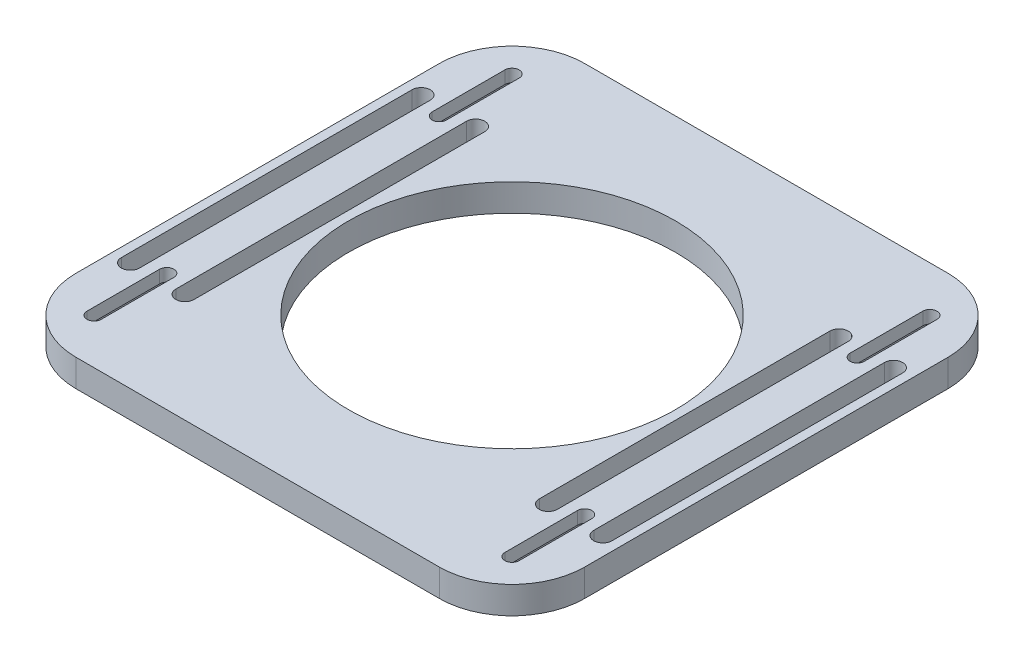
ISO-10303-21;
HEADER;
FILE_DESCRIPTION(('STEP AP214'),'2;1');
FILE_NAME('part.step','',(''),(''),'','','');
FILE_SCHEMA(('AUTOMOTIVE_DESIGN { 1 0 10303 214 1 1 1 1 }'));
ENDSEC;
DATA;
#1=APPLICATION_CONTEXT('core data for automotive mechanical design processes');
#2=APPLICATION_PROTOCOL_DEFINITION('international standard','automotive_design',2000,#1);
#3=PRODUCT_CONTEXT('',#1,'mechanical');
#4=PRODUCT('Part','Part','',(#3));
#5=PRODUCT_RELATED_PRODUCT_CATEGORY('part','',(#4));
#6=PRODUCT_DEFINITION_FORMATION('','',#4);
#7=PRODUCT_DEFINITION_CONTEXT('part definition',#1,'design');
#8=PRODUCT_DEFINITION('design','',#6,#7);
#9=PRODUCT_DEFINITION_SHAPE('','',#8);
#10=(LENGTH_UNIT() NAMED_UNIT(*) SI_UNIT(.MILLI.,.METRE.));
#11=(NAMED_UNIT(*) PLANE_ANGLE_UNIT() SI_UNIT($,.RADIAN.));
#12=(NAMED_UNIT(*) SI_UNIT($,.STERADIAN.) SOLID_ANGLE_UNIT());
#13=UNCERTAINTY_MEASURE_WITH_UNIT(LENGTH_MEASURE(1.E-05),#10,'distance_accuracy_value','');
#14=(GEOMETRIC_REPRESENTATION_CONTEXT(3) GLOBAL_UNCERTAINTY_ASSIGNED_CONTEXT((#13)) GLOBAL_UNIT_ASSIGNED_CONTEXT((#10,
#11,#12)) REPRESENTATION_CONTEXT('',''));
#15=CARTESIAN_POINT('',(0.,0.,0.));
#16=DIRECTION('',(0.,0.,1.));
#17=DIRECTION('',(1.,0.,0.));
#18=AXIS2_PLACEMENT_3D('',#15,#16,#17);
#19=CARTESIAN_POINT('',(73.025,0.,73.025));
#20=DIRECTION('',(0.,1.,0.));
#21=DIRECTION('',(0.,0.,1.));
#22=AXIS2_PLACEMENT_3D('',#19,#20,#21);
#23=CYLINDRICAL_SURFACE('',#22,2.48919999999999);
#24=CARTESIAN_POINT('',(73.025,5.08,73.025));
#25=DIRECTION('',(0.,-1.,0.));
#26=DIRECTION('',(0.,0.,-1.));
#27=AXIS2_PLACEMENT_3D('',#24,#25,#26);
#28=CIRCLE('',#27,2.48919999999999);
#29=CARTESIAN_POINT('',(70.5358,5.08,73.025));
#30=VERTEX_POINT('',#29);
#31=CARTESIAN_POINT('',(75.5142,5.08,73.025));
#32=VERTEX_POINT('',#31);
#33=EDGE_CURVE('E549',#30,#32,#28,.F.);
#34=ORIENTED_EDGE('',*,*,#33,.F.);
#35=DIRECTION('',(0.,1.,0.));
#36=VECTOR('',#35,1.);
#37=CARTESIAN_POINT('',(70.5358,0.,73.025));
#38=LINE('',#37,#36);
#39=CARTESIAN_POINT('',(70.5358,9.525,73.025));
#40=VERTEX_POINT('',#39);
#41=EDGE_CURVE('E624',#30,#40,#38,.T.);
#42=ORIENTED_EDGE('',*,*,#41,.T.);
#43=CARTESIAN_POINT('',(73.025,9.525,73.025));
#44=DIRECTION('',(0.,1.,0.));
#45=DIRECTION('',(0.,0.,1.));
#46=AXIS2_PLACEMENT_3D('',#43,#44,#45);
#47=CIRCLE('',#46,2.48919999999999);
#48=CARTESIAN_POINT('',(75.5142,9.525,73.025));
#49=VERTEX_POINT('',#48);
#50=EDGE_CURVE('E588',#40,#49,#47,.T.);
#51=ORIENTED_EDGE('',*,*,#50,.T.);
#52=DIRECTION('',(0.,1.,0.));
#53=VECTOR('',#52,1.);
#54=CARTESIAN_POINT('',(75.5142,0.,73.025));
#55=LINE('',#54,#53);
#56=EDGE_CURVE('E623',#32,#49,#55,.T.);
#57=ORIENTED_EDGE('',*,*,#56,.F.);
#58=EDGE_LOOP('',(#34,#42,#51,#57));
#59=FACE_BOUND('',#58,.T.);
#60=ADVANCED_FACE('F34',(#59),#23,.F.);
#61=CARTESIAN_POINT('',(70.5358,0.,73.025));
#62=DIRECTION('',(-1.,0.,0.));
#63=DIRECTION('',(0.,0.,1.));
#64=AXIS2_PLACEMENT_3D('',#61,#62,#63);
#65=PLANE('',#64);
#66=DIRECTION('',(0.,0.,1.));
#67=VECTOR('',#66,1.);
#68=CARTESIAN_POINT('',(70.5358,5.08,73.025));
#69=LINE('',#68,#67);
#70=CARTESIAN_POINT('',(70.5358,5.08,47.625));
#71=VERTEX_POINT('',#70);
#72=EDGE_CURVE('E547',#71,#30,#69,.T.);
#73=ORIENTED_EDGE('',*,*,#72,.F.);
#74=DIRECTION('',(0.,1.,0.));
#75=VECTOR('',#74,1.);
#76=CARTESIAN_POINT('',(70.5358,0.,47.625));
#77=LINE('',#76,#75);
#78=CARTESIAN_POINT('',(70.5358,9.525,47.625));
#79=VERTEX_POINT('',#78);
#80=EDGE_CURVE('E627',#71,#79,#77,.T.);
#81=ORIENTED_EDGE('',*,*,#80,.T.);
#82=DIRECTION('',(0.,0.,1.));
#83=VECTOR('',#82,1.);
#84=CARTESIAN_POINT('',(70.5358,9.525,73.025));
#85=LINE('',#84,#83);
#86=EDGE_CURVE('E620',#79,#40,#85,.T.);
#87=ORIENTED_EDGE('',*,*,#86,.T.);
#88=ORIENTED_EDGE('',*,*,#41,.F.);
#89=EDGE_LOOP('',(#73,#81,#87,#88));
#90=FACE_BOUND('',#89,.T.);
#91=ADVANCED_FACE('F867',(#90),#65,.F.);
#92=CARTESIAN_POINT('',(73.025,0.,47.625));
#93=DIRECTION('',(0.,1.,0.));
#94=DIRECTION('',(0.,0.,1.));
#95=AXIS2_PLACEMENT_3D('',#92,#93,#94);
#96=CYLINDRICAL_SURFACE('',#95,2.48919999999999);
#97=CARTESIAN_POINT('',(73.025,5.08,47.625));
#98=DIRECTION('',(0.,-1.,0.));
#99=DIRECTION('',(0.,0.,-1.));
#100=AXIS2_PLACEMENT_3D('',#97,#98,#99);
#101=CIRCLE('',#100,2.48919999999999);
#102=CARTESIAN_POINT('',(75.5142,5.08,47.625));
#103=VERTEX_POINT('',#102);
#104=EDGE_CURVE('E545',#103,#71,#101,.F.);
#105=ORIENTED_EDGE('',*,*,#104,.F.);
#106=DIRECTION('',(0.,1.,0.));
#107=VECTOR('',#106,1.);
#108=CARTESIAN_POINT('',(75.5142,0.,47.625));
#109=LINE('',#108,#107);
#110=CARTESIAN_POINT('',(75.5142,9.525,47.625));
#111=VERTEX_POINT('',#110);
#112=EDGE_CURVE('E629',#103,#111,#109,.T.);
#113=ORIENTED_EDGE('',*,*,#112,.T.);
#114=CARTESIAN_POINT('',(73.025,9.525,47.625));
#115=DIRECTION('',(0.,1.,0.));
#116=DIRECTION('',(0.,0.,1.));
#117=AXIS2_PLACEMENT_3D('',#114,#115,#116);
#118=CIRCLE('',#117,2.48919999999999);
#119=EDGE_CURVE('E617',#111,#79,#118,.T.);
#120=ORIENTED_EDGE('',*,*,#119,.T.);
#121=ORIENTED_EDGE('',*,*,#80,.F.);
#122=EDGE_LOOP('',(#105,#113,#120,#121));
#123=FACE_BOUND('',#122,.T.);
#124=ADVANCED_FACE('F861',(#123),#96,.F.);
#125=CARTESIAN_POINT('',(75.5142,0.,73.025));
#126=DIRECTION('',(1.,0.,0.));
#127=DIRECTION('',(0.,0.,-1.));
#128=AXIS2_PLACEMENT_3D('',#125,#126,#127);
#129=PLANE('',#128);
#130=DIRECTION('',(0.,0.,-1.));
#131=VECTOR('',#130,1.);
#132=CARTESIAN_POINT('',(75.5142,5.08,73.025));
#133=LINE('',#132,#131);
#134=EDGE_CURVE('E11',#32,#103,#133,.T.);
#135=ORIENTED_EDGE('',*,*,#134,.F.);
#136=ORIENTED_EDGE('',*,*,#56,.T.);
#137=DIRECTION('',(0.,0.,-1.));
#138=VECTOR('',#137,1.);
#139=CARTESIAN_POINT('',(75.5142,9.525,73.025));
#140=LINE('',#139,#138);
#141=EDGE_CURVE('E614',#49,#111,#140,.T.);
#142=ORIENTED_EDGE('',*,*,#141,.T.);
#143=ORIENTED_EDGE('',*,*,#112,.F.);
#144=EDGE_LOOP('',(#135,#136,#142,#143));
#145=FACE_BOUND('',#144,.T.);
#146=ADVANCED_FACE('F854',(#145),#129,.F.);
#147=CARTESIAN_POINT('',(-73.025,0.,-73.025));
#148=DIRECTION('',(0.,1.,0.));
#149=DIRECTION('',(0.,0.,1.));
#150=AXIS2_PLACEMENT_3D('',#147,#148,#149);
#151=CYLINDRICAL_SURFACE('',#150,2.48919999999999);
#152=CARTESIAN_POINT('',(-73.025,5.08,-73.025));
#153=DIRECTION('',(0.,-1.,0.));
#154=DIRECTION('',(0.,0.,-1.));
#155=AXIS2_PLACEMENT_3D('',#152,#153,#154);
#156=CIRCLE('',#155,2.48919999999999);
#157=CARTESIAN_POINT('',(-70.5358,5.08,-73.025));
#158=VERTEX_POINT('',#157);
#159=CARTESIAN_POINT('',(-75.5141999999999,5.08,-73.025));
#160=VERTEX_POINT('',#159);
#161=EDGE_CURVE('E543',#158,#160,#156,.F.);
#162=ORIENTED_EDGE('',*,*,#161,.F.);
#163=DIRECTION('',(0.,1.,0.));
#164=VECTOR('',#163,1.);
#165=CARTESIAN_POINT('',(-70.5358,0.,-73.025));
#166=LINE('',#165,#164);
#167=CARTESIAN_POINT('',(-70.5358,9.525,-73.025));
#168=VERTEX_POINT('',#167);
#169=EDGE_CURVE('E564',#158,#168,#166,.T.);
#170=ORIENTED_EDGE('',*,*,#169,.T.);
#171=CARTESIAN_POINT('',(-73.025,9.525,-73.025));
#172=DIRECTION('',(0.,1.,0.));
#173=DIRECTION('',(0.,0.,1.));
#174=AXIS2_PLACEMENT_3D('',#171,#172,#173);
#175=CIRCLE('',#174,2.48919999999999);
#176=CARTESIAN_POINT('',(-75.5141999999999,9.525,-73.025));
#177=VERTEX_POINT('',#176);
#178=EDGE_CURVE('E551',#168,#177,#175,.T.);
#179=ORIENTED_EDGE('',*,*,#178,.T.);
#180=DIRECTION('',(0.,1.,0.));
#181=VECTOR('',#180,1.);
#182=CARTESIAN_POINT('',(-75.5141999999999,0.,-73.025));
#183=LINE('',#182,#181);
#184=EDGE_CURVE('E563',#160,#177,#183,.T.);
#185=ORIENTED_EDGE('',*,*,#184,.F.);
#186=EDGE_LOOP('',(#162,#170,#179,#185));
#187=FACE_BOUND('',#186,.T.);
#188=ADVANCED_FACE('F852',(#187),#151,.F.);
#189=CARTESIAN_POINT('',(-70.5358,0.,-73.025));
#190=DIRECTION('',(1.,0.,0.));
#191=DIRECTION('',(0.,0.,-1.));
#192=AXIS2_PLACEMENT_3D('',#189,#190,#191);
#193=PLANE('',#192);
#194=DIRECTION('',(0.,0.,-1.));
#195=VECTOR('',#194,1.);
#196=CARTESIAN_POINT('',(-70.5358,5.08,-73.025));
#197=LINE('',#196,#195);
#198=CARTESIAN_POINT('',(-70.5358,5.08,-47.625));
#199=VERTEX_POINT('',#198);
#200=EDGE_CURVE('E541',#199,#158,#197,.T.);
#201=ORIENTED_EDGE('',*,*,#200,.F.);
#202=DIRECTION('',(0.,1.,0.));
#203=VECTOR('',#202,1.);
#204=CARTESIAN_POINT('',(-70.5358,0.,-47.625));
#205=LINE('',#204,#203);
#206=CARTESIAN_POINT('',(-70.5358,9.525,-47.625));
#207=VERTEX_POINT('',#206);
#208=EDGE_CURVE('E567',#199,#207,#205,.T.);
#209=ORIENTED_EDGE('',*,*,#208,.T.);
#210=DIRECTION('',(0.,0.,-1.));
#211=VECTOR('',#210,1.);
#212=CARTESIAN_POINT('',(-70.5358,9.525,-73.025));
#213=LINE('',#212,#211);
#214=EDGE_CURVE('E560',#207,#168,#213,.T.);
#215=ORIENTED_EDGE('',*,*,#214,.T.);
#216=ORIENTED_EDGE('',*,*,#169,.F.);
#217=EDGE_LOOP('',(#201,#209,#215,#216));
#218=FACE_BOUND('',#217,.T.);
#219=ADVANCED_FACE('F850',(#218),#193,.F.);
#220=CARTESIAN_POINT('',(-73.025,0.,-47.625));
#221=DIRECTION('',(0.,1.,0.));
#222=DIRECTION('',(0.,0.,1.));
#223=AXIS2_PLACEMENT_3D('',#220,#221,#222);
#224=CYLINDRICAL_SURFACE('',#223,2.48919999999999);
#225=CARTESIAN_POINT('',(-73.025,5.08,-47.625));
#226=DIRECTION('',(0.,-1.,0.));
#227=DIRECTION('',(0.,0.,-1.));
#228=AXIS2_PLACEMENT_3D('',#225,#226,#227);
#229=CIRCLE('',#228,2.48919999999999);
#230=CARTESIAN_POINT('',(-75.5141999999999,5.08,-47.625));
#231=VERTEX_POINT('',#230);
#232=EDGE_CURVE('E539',#231,#199,#229,.F.);
#233=ORIENTED_EDGE('',*,*,#232,.F.);
#234=DIRECTION('',(0.,1.,0.));
#235=VECTOR('',#234,1.);
#236=CARTESIAN_POINT('',(-75.5141999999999,0.,-47.625));
#237=LINE('',#236,#235);
#238=CARTESIAN_POINT('',(-75.5141999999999,9.525,-47.625));
#239=VERTEX_POINT('',#238);
#240=EDGE_CURVE('E569',#231,#239,#237,.T.);
#241=ORIENTED_EDGE('',*,*,#240,.T.);
#242=CARTESIAN_POINT('',(-73.025,9.525,-47.625));
#243=DIRECTION('',(0.,1.,0.));
#244=DIRECTION('',(0.,0.,1.));
#245=AXIS2_PLACEMENT_3D('',#242,#243,#244);
#246=CIRCLE('',#245,2.48919999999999);
#247=EDGE_CURVE('E557',#239,#207,#246,.T.);
#248=ORIENTED_EDGE('',*,*,#247,.T.);
#249=ORIENTED_EDGE('',*,*,#208,.F.);
#250=EDGE_LOOP('',(#233,#241,#248,#249));
#251=FACE_BOUND('',#250,.T.);
#252=ADVANCED_FACE('F839',(#251),#224,.F.);
#253=CARTESIAN_POINT('',(-75.5141999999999,0.,-73.025));
#254=DIRECTION('',(-1.,0.,0.));
#255=DIRECTION('',(0.,0.,1.));
#256=AXIS2_PLACEMENT_3D('',#253,#254,#255);
#257=PLANE('',#256);
#258=DIRECTION('',(0.,0.,1.));
#259=VECTOR('',#258,1.);
#260=CARTESIAN_POINT('',(-75.5141999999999,5.08,-73.025));
#261=LINE('',#260,#259);
#262=EDGE_CURVE('E42',#160,#231,#261,.T.);
#263=ORIENTED_EDGE('',*,*,#262,.F.);
#264=ORIENTED_EDGE('',*,*,#184,.T.);
#265=DIRECTION('',(0.,0.,1.));
#266=VECTOR('',#265,1.);
#267=CARTESIAN_POINT('',(-75.5141999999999,9.525,-73.025));
#268=LINE('',#267,#266);
#269=EDGE_CURVE('E554',#177,#239,#268,.T.);
#270=ORIENTED_EDGE('',*,*,#269,.T.);
#271=ORIENTED_EDGE('',*,*,#240,.F.);
#272=EDGE_LOOP('',(#263,#264,#270,#271));
#273=FACE_BOUND('',#272,.T.);
#274=ADVANCED_FACE('F840',(#273),#257,.F.);
#275=CARTESIAN_POINT('',(0.,9.525,0.));
#276=DIRECTION('',(0.,1.,0.));
#277=DIRECTION('',(0.,0.,1.));
#278=AXIS2_PLACEMENT_3D('',#275,#276,#277);
#279=PLANE('',#278);
#280=CARTESIAN_POINT('',(73.025,9.525,-73.025));
#281=DIRECTION('',(0.,1.,0.));
#282=DIRECTION('',(0.,0.,-1.));
#283=AXIS2_PLACEMENT_3D('',#280,#281,#282);
#284=CIRCLE('',#283,2.48919999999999);
#285=CARTESIAN_POINT('',(75.5141999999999,9.525,-73.025));
#286=VERTEX_POINT('',#285);
#287=CARTESIAN_POINT('',(70.5358,9.525,-73.025));
#288=VERTEX_POINT('',#287);
#289=EDGE_CURVE('E572',#286,#288,#284,.T.);
#290=ORIENTED_EDGE('',*,*,#289,.F.);
#291=DIRECTION('',(0.,0.,-1.));
#292=VECTOR('',#291,1.);
#293=CARTESIAN_POINT('',(75.5141999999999,9.525,-73.025));
#294=LINE('',#293,#292);
#295=CARTESIAN_POINT('',(75.5141999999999,9.525,-47.625));
#296=VERTEX_POINT('',#295);
#297=EDGE_CURVE('E582',#296,#286,#294,.T.);
#298=ORIENTED_EDGE('',*,*,#297,.F.);
#299=CARTESIAN_POINT('',(73.025,9.525,-47.625));
#300=DIRECTION('',(0.,1.,0.));
#301=DIRECTION('',(0.,0.,-1.));
#302=AXIS2_PLACEMENT_3D('',#299,#300,#301);
#303=CIRCLE('',#302,2.48919999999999);
#304=CARTESIAN_POINT('',(70.5358,9.525,-47.625));
#305=VERTEX_POINT('',#304);
#306=EDGE_CURVE('E579',#305,#296,#303,.T.);
#307=ORIENTED_EDGE('',*,*,#306,.F.);
#308=DIRECTION('',(0.,0.,1.));
#309=VECTOR('',#308,1.);
#310=CARTESIAN_POINT('',(70.5358,9.525,-73.025));
#311=LINE('',#310,#309);
#312=EDGE_CURVE('E575',#288,#305,#311,.T.);
#313=ORIENTED_EDGE('',*,*,#312,.F.);
#314=EDGE_LOOP('',(#290,#298,#307,#313));
#315=FACE_BOUND('',#314,.T.);
#316=CARTESIAN_POINT('',(-73.0249999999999,9.525,73.025));
#317=DIRECTION('',(0.,1.,0.));
#318=DIRECTION('',(0.,0.,-1.));
#319=AXIS2_PLACEMENT_3D('',#316,#317,#318);
#320=CIRCLE('',#319,2.48919999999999);
#321=CARTESIAN_POINT('',(-75.5141999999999,9.525,73.025));
#322=VERTEX_POINT('',#321);
#323=CARTESIAN_POINT('',(-70.5358,9.525,73.025));
#324=VERTEX_POINT('',#323);
#325=EDGE_CURVE('E566',#322,#324,#320,.T.);
#326=ORIENTED_EDGE('',*,*,#325,.F.);
#327=DIRECTION('',(0.,0.,1.));
#328=VECTOR('',#327,1.);
#329=CARTESIAN_POINT('',(-75.5141999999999,9.525,73.025));
#330=LINE('',#329,#328);
#331=CARTESIAN_POINT('',(-75.5141999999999,9.525,47.625));
#332=VERTEX_POINT('',#331);
#333=EDGE_CURVE('E602',#332,#322,#330,.T.);
#334=ORIENTED_EDGE('',*,*,#333,.F.);
#335=CARTESIAN_POINT('',(-73.0249999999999,9.525,47.625));
#336=DIRECTION('',(0.,1.,0.));
#337=DIRECTION('',(0.,0.,-1.));
#338=AXIS2_PLACEMENT_3D('',#335,#336,#337);
#339=CIRCLE('',#338,2.48919999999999);
#340=CARTESIAN_POINT('',(-70.5358,9.525,47.625));
#341=VERTEX_POINT('',#340);
#342=EDGE_CURVE('E599',#341,#332,#339,.T.);
#343=ORIENTED_EDGE('',*,*,#342,.F.);
#344=DIRECTION('',(0.,0.,-1.));
#345=VECTOR('',#344,1.);
#346=CARTESIAN_POINT('',(-70.5358,9.525,73.025));
#347=LINE('',#346,#345);
#348=EDGE_CURVE('E596',#324,#341,#347,.T.);
#349=ORIENTED_EDGE('',*,*,#348,.F.);
#350=EDGE_LOOP('',(#326,#334,#343,#349));
#351=FACE_BOUND('',#350,.T.);
#352=ORIENTED_EDGE('',*,*,#178,.F.);
#353=ORIENTED_EDGE('',*,*,#214,.F.);
#354=ORIENTED_EDGE('',*,*,#247,.F.);
#355=ORIENTED_EDGE('',*,*,#269,.F.);
#356=EDGE_LOOP('',(#352,#353,#354,#355));
#357=FACE_BOUND('',#356,.T.);
#358=ORIENTED_EDGE('',*,*,#50,.F.);
#359=ORIENTED_EDGE('',*,*,#86,.F.);
#360=ORIENTED_EDGE('',*,*,#119,.F.);
#361=ORIENTED_EDGE('',*,*,#141,.F.);
#362=EDGE_LOOP('',(#358,#359,#360,#361));
#363=FACE_BOUND('',#362,.T.);
#364=CARTESIAN_POINT('',(82.55,9.525,-50.8));
#365=DIRECTION('',(0.,1.,0.));
#366=DIRECTION('',(0.,0.,1.));
#367=AXIS2_PLACEMENT_3D('',#364,#365,#366);
#368=CIRCLE('',#367,3.17500000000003);
#369=CARTESIAN_POINT('',(85.7250000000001,9.525,-50.8));
#370=VERTEX_POINT('',#369);
#371=CARTESIAN_POINT('',(79.375,9.525,-50.8));
#372=VERTEX_POINT('',#371);
#373=EDGE_CURVE('E646',#370,#372,#368,.T.);
#374=ORIENTED_EDGE('',*,*,#373,.F.);
#375=DIRECTION('',(0.,0.,-1.));
#376=VECTOR('',#375,1.);
#377=CARTESIAN_POINT('',(85.7250000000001,9.525,-50.8));
#378=LINE('',#377,#376);
#379=CARTESIAN_POINT('',(85.7250000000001,9.525,50.8));
#380=VERTEX_POINT('',#379);
#381=EDGE_CURVE('E636',#380,#370,#378,.T.);
#382=ORIENTED_EDGE('',*,*,#381,.F.);
#383=CARTESIAN_POINT('',(82.55,9.525,50.8));
#384=DIRECTION('',(0.,1.,0.));
#385=DIRECTION('',(0.,0.,1.));
#386=AXIS2_PLACEMENT_3D('',#383,#384,#385);
#387=CIRCLE('',#386,3.17500000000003);
#388=CARTESIAN_POINT('',(79.375,9.525,50.8));
#389=VERTEX_POINT('',#388);
#390=EDGE_CURVE('E652',#389,#380,#387,.T.);
#391=ORIENTED_EDGE('',*,*,#390,.F.);
#392=DIRECTION('',(0.,0.,1.));
#393=VECTOR('',#392,1.);
#394=CARTESIAN_POINT('',(79.375,9.525,-50.8));
#395=LINE('',#394,#393);
#396=EDGE_CURVE('E648',#372,#389,#395,.T.);
#397=ORIENTED_EDGE('',*,*,#396,.F.);
#398=EDGE_LOOP('',(#374,#382,#391,#397));
#399=FACE_BOUND('',#398,.T.);
#400=CARTESIAN_POINT('',(-63.4999999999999,9.525,-50.8));
#401=DIRECTION('',(0.,1.,0.));
#402=DIRECTION('',(0.,0.,1.));
#403=AXIS2_PLACEMENT_3D('',#400,#401,#402);
#404=CIRCLE('',#403,3.17500000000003);
#405=CARTESIAN_POINT('',(-60.3249999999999,9.525,-50.8));
#406=VERTEX_POINT('',#405);
#407=CARTESIAN_POINT('',(-66.675,9.525,-50.8));
#408=VERTEX_POINT('',#407);
#409=EDGE_CURVE('E626',#406,#408,#404,.T.);
#410=ORIENTED_EDGE('',*,*,#409,.F.);
#411=DIRECTION('',(0.,0.,-1.));
#412=VECTOR('',#411,1.);
#413=CARTESIAN_POINT('',(-60.3249999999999,9.525,-50.8));
#414=LINE('',#413,#412);
#415=CARTESIAN_POINT('',(-60.3249999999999,9.525,50.8));
#416=VERTEX_POINT('',#415);
#417=EDGE_CURVE('E670',#416,#406,#414,.T.);
#418=ORIENTED_EDGE('',*,*,#417,.F.);
#419=CARTESIAN_POINT('',(-63.4999999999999,9.525,50.8));
#420=DIRECTION('',(0.,1.,0.));
#421=DIRECTION('',(0.,0.,1.));
#422=AXIS2_PLACEMENT_3D('',#419,#420,#421);
#423=CIRCLE('',#422,3.17500000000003);
#424=CARTESIAN_POINT('',(-66.675,9.525,50.8));
#425=VERTEX_POINT('',#424);
#426=EDGE_CURVE('E684',#425,#416,#423,.T.);
#427=ORIENTED_EDGE('',*,*,#426,.F.);
#428=DIRECTION('',(0.,0.,1.));
#429=VECTOR('',#428,1.);
#430=CARTESIAN_POINT('',(-66.675,9.525,-50.8));
#431=LINE('',#430,#429);
#432=EDGE_CURVE('E681',#408,#425,#431,.T.);
#433=ORIENTED_EDGE('',*,*,#432,.F.);
#434=EDGE_LOOP('',(#410,#418,#427,#433));
#435=FACE_BOUND('',#434,.T.);
#436=CARTESIAN_POINT('',(-82.55,9.525,-50.8));
#437=DIRECTION('',(0.,1.,0.));
#438=DIRECTION('',(0.,0.,-1.));
#439=AXIS2_PLACEMENT_3D('',#436,#437,#438);
#440=CIRCLE('',#439,3.17500000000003);
#441=CARTESIAN_POINT('',(-79.375,9.525,-50.8));
#442=VERTEX_POINT('',#441);
#443=CARTESIAN_POINT('',(-85.7250000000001,9.525,-50.8));
#444=VERTEX_POINT('',#443);
#445=EDGE_CURVE('E691',#442,#444,#440,.T.);
#446=ORIENTED_EDGE('',*,*,#445,.F.);
#447=DIRECTION('',(0.,0.,-1.));
#448=VECTOR('',#447,1.);
#449=CARTESIAN_POINT('',(-79.375,9.525,-50.8));
#450=LINE('',#449,#448);
#451=CARTESIAN_POINT('',(-79.375,9.525,50.8));
#452=VERTEX_POINT('',#451);
#453=EDGE_CURVE('E734',#452,#442,#450,.T.);
#454=ORIENTED_EDGE('',*,*,#453,.F.);
#455=CARTESIAN_POINT('',(-82.55,9.525,50.8));
#456=DIRECTION('',(0.,1.,0.));
#457=DIRECTION('',(0.,0.,-1.));
#458=AXIS2_PLACEMENT_3D('',#455,#456,#457);
#459=CIRCLE('',#458,3.17500000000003);
#460=CARTESIAN_POINT('',(-85.7250000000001,9.525,50.8));
#461=VERTEX_POINT('',#460);
#462=EDGE_CURVE('E748',#461,#452,#459,.T.);
#463=ORIENTED_EDGE('',*,*,#462,.F.);
#464=DIRECTION('',(0.,0.,1.));
#465=VECTOR('',#464,1.);
#466=CARTESIAN_POINT('',(-85.7250000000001,9.525,-50.8));
#467=LINE('',#466,#465);
#468=EDGE_CURVE('E745',#444,#461,#467,.T.);
#469=ORIENTED_EDGE('',*,*,#468,.F.);
#470=EDGE_LOOP('',(#446,#454,#463,#469));
#471=FACE_BOUND('',#470,.T.);
#472=CARTESIAN_POINT('',(63.4999999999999,9.525,-50.8));
#473=DIRECTION('',(0.,1.,0.));
#474=DIRECTION('',(0.,0.,-1.));
#475=AXIS2_PLACEMENT_3D('',#472,#473,#474);
#476=CIRCLE('',#475,3.17500000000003);
#477=CARTESIAN_POINT('',(66.675,9.525,-50.8));
#478=VERTEX_POINT('',#477);
#479=CARTESIAN_POINT('',(60.3249999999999,9.525,-50.8));
#480=VERTEX_POINT('',#479);
#481=EDGE_CURVE('E712',#478,#480,#476,.T.);
#482=ORIENTED_EDGE('',*,*,#481,.F.);
#483=DIRECTION('',(0.,0.,-1.));
#484=VECTOR('',#483,1.);
#485=CARTESIAN_POINT('',(66.675,9.525,-50.8));
#486=LINE('',#485,#484);
#487=CARTESIAN_POINT('',(66.675,9.525,50.8));
#488=VERTEX_POINT('',#487);
#489=EDGE_CURVE('E702',#488,#478,#486,.T.);
#490=ORIENTED_EDGE('',*,*,#489,.F.);
#491=CARTESIAN_POINT('',(63.4999999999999,9.525,50.8));
#492=DIRECTION('',(0.,1.,0.));
#493=DIRECTION('',(0.,0.,-1.));
#494=AXIS2_PLACEMENT_3D('',#491,#492,#493);
#495=CIRCLE('',#494,3.17500000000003);
#496=CARTESIAN_POINT('',(60.3249999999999,9.525,50.8));
#497=VERTEX_POINT('',#496);
#498=EDGE_CURVE('E718',#497,#488,#495,.T.);
#499=ORIENTED_EDGE('',*,*,#498,.F.);
#500=DIRECTION('',(0.,0.,1.));
#501=VECTOR('',#500,1.);
#502=CARTESIAN_POINT('',(60.3249999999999,9.525,-50.8));
#503=LINE('',#502,#501);
#504=EDGE_CURVE('E714',#480,#497,#503,.T.);
#505=ORIENTED_EDGE('',*,*,#504,.F.);
#506=EDGE_LOOP('',(#482,#490,#499,#505));
#507=FACE_BOUND('',#506,.T.);
#508=DIRECTION('',(-1.,0.,0.));
#509=VECTOR('',#508,1.);
#510=CARTESIAN_POINT('',(-88.9,9.525,-88.9));
#511=LINE('',#510,#509);
#512=CARTESIAN_POINT('',(63.4999999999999,9.525,-88.9));
#513=VERTEX_POINT('',#512);
#514=CARTESIAN_POINT('',(-63.5,9.525,-88.9));
#515=VERTEX_POINT('',#514);
#516=EDGE_CURVE('E769',#513,#515,#511,.T.);
#517=ORIENTED_EDGE('',*,*,#516,.T.);
#518=CARTESIAN_POINT('',(-63.5,9.525,-63.5));
#519=DIRECTION('',(0.,1.,0.));
#520=DIRECTION('',(0.,0.,1.));
#521=AXIS2_PLACEMENT_3D('',#518,#519,#520);
#522=CIRCLE('',#521,25.4);
#523=CARTESIAN_POINT('',(-88.9,9.525,-63.5));
#524=VERTEX_POINT('',#523);
#525=EDGE_CURVE('E813',#515,#524,#522,.T.);
#526=ORIENTED_EDGE('',*,*,#525,.T.);
#527=DIRECTION('',(0.,0.,1.));
#528=VECTOR('',#527,1.);
#529=CARTESIAN_POINT('',(-88.9,9.525,-88.9));
#530=LINE('',#529,#528);
#531=CARTESIAN_POINT('',(-88.9,9.525,63.5));
#532=VERTEX_POINT('',#531);
#533=EDGE_CURVE('E773',#524,#532,#530,.T.);
#534=ORIENTED_EDGE('',*,*,#533,.T.);
#535=CARTESIAN_POINT('',(-63.5,9.525,63.5));
#536=DIRECTION('',(0.,1.,0.));
#537=DIRECTION('',(0.,0.,1.));
#538=AXIS2_PLACEMENT_3D('',#535,#536,#537);
#539=CIRCLE('',#538,25.4);
#540=CARTESIAN_POINT('',(-63.5,9.525,88.9));
#541=VERTEX_POINT('',#540);
#542=EDGE_CURVE('E807',#532,#541,#539,.T.);
#543=ORIENTED_EDGE('',*,*,#542,.T.);
#544=DIRECTION('',(1.,0.,0.));
#545=VECTOR('',#544,1.);
#546=CARTESIAN_POINT('',(-88.9,9.525,88.9));
#547=LINE('',#546,#545);
#548=CARTESIAN_POINT('',(63.5,9.525,88.9));
#549=VERTEX_POINT('',#548);
#550=EDGE_CURVE('E776',#541,#549,#547,.T.);
#551=ORIENTED_EDGE('',*,*,#550,.T.);
#552=CARTESIAN_POINT('',(63.5,9.525,63.4999999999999));
#553=DIRECTION('',(0.,1.,0.));
#554=DIRECTION('',(0.,0.,1.));
#555=AXIS2_PLACEMENT_3D('',#552,#553,#554);
#556=CIRCLE('',#555,25.4);
#557=CARTESIAN_POINT('',(88.9,9.525,63.4999999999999));
#558=VERTEX_POINT('',#557);
#559=EDGE_CURVE('E809',#549,#558,#556,.T.);
#560=ORIENTED_EDGE('',*,*,#559,.T.);
#561=DIRECTION('',(0.,0.,-1.));
#562=VECTOR('',#561,1.);
#563=CARTESIAN_POINT('',(88.9,9.525,-88.9));
#564=LINE('',#563,#562);
#565=CARTESIAN_POINT('',(88.9,9.525,-63.5));
#566=VERTEX_POINT('',#565);
#567=EDGE_CURVE('E766',#558,#566,#564,.T.);
#568=ORIENTED_EDGE('',*,*,#567,.T.);
#569=CARTESIAN_POINT('',(63.4999999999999,9.525,-63.5));
#570=DIRECTION('',(0.,1.,0.));
#571=DIRECTION('',(0.,0.,1.));
#572=AXIS2_PLACEMENT_3D('',#569,#570,#571);
#573=CIRCLE('',#572,25.4);
#574=EDGE_CURVE('E811',#566,#513,#573,.T.);
#575=ORIENTED_EDGE('',*,*,#574,.T.);
#576=EDGE_LOOP('',(#517,#526,#534,#543,#551,#560,#568,#575));
#577=FACE_BOUND('',#576,.T.);
#578=CARTESIAN_POINT('',(0.,9.525,0.));
#579=DIRECTION('',(0.,1.,0.));
#580=DIRECTION('',(0.,0.,1.));
#581=AXIS2_PLACEMENT_3D('',#578,#579,#580);
#582=CIRCLE('',#581,57.15);
#583=CARTESIAN_POINT('',(0.,9.525,-57.15));
#584=VERTEX_POINT('',#583);
#585=EDGE_CURVE('E760',#584,#584,#582,.T.);
#586=ORIENTED_EDGE('',*,*,#585,.F.);
#587=EDGE_LOOP('',(#586));
#588=FACE_BOUND('',#587,.T.);
#589=ADVANCED_FACE('F846',(#315,#351,#357,#363,#399,#435,#471,#507,#577,#588),#279,.T.);
#590=CARTESIAN_POINT('',(0.,0.,0.));
#591=DIRECTION('',(0.,1.,0.));
#592=DIRECTION('',(0.,0.,1.));
#593=AXIS2_PLACEMENT_3D('',#590,#591,#592);
#594=PLANE('',#593);
#595=DIRECTION('',(0.,0.,-1.));
#596=VECTOR('',#595,1.);
#597=CARTESIAN_POINT('',(-77.47,0.,73.025));
#598=LINE('',#597,#596);
#599=CARTESIAN_POINT('',(-77.47,0.,73.025));
#600=VERTEX_POINT('',#599);
#601=CARTESIAN_POINT('',(-77.47,0.,47.625));
#602=VERTEX_POINT('',#601);
#603=EDGE_CURVE('E444',#600,#602,#598,.T.);
#604=ORIENTED_EDGE('',*,*,#603,.F.);
#605=CARTESIAN_POINT('',(-73.025,0.,73.025));
#606=DIRECTION('',(0.,-1.,0.));
#607=DIRECTION('',(0.,0.,1.));
#608=AXIS2_PLACEMENT_3D('',#605,#606,#607);
#609=CIRCLE('',#608,4.44499999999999);
#610=CARTESIAN_POINT('',(-68.58,0.,73.025));
#611=VERTEX_POINT('',#610);
#612=EDGE_CURVE('E49',#611,#600,#609,.T.);
#613=ORIENTED_EDGE('',*,*,#612,.F.);
#614=DIRECTION('',(0.,0.,1.));
#615=VECTOR('',#614,1.);
#616=CARTESIAN_POINT('',(-68.58,0.,73.025));
#617=LINE('',#616,#615);
#618=CARTESIAN_POINT('',(-68.58,0.,47.625));
#619=VERTEX_POINT('',#618);
#620=EDGE_CURVE('E433',#619,#611,#617,.T.);
#621=ORIENTED_EDGE('',*,*,#620,.F.);
#622=CARTESIAN_POINT('',(-73.025,0.,47.625));
#623=DIRECTION('',(0.,-1.,0.));
#624=DIRECTION('',(0.,0.,1.));
#625=AXIS2_PLACEMENT_3D('',#622,#623,#624);
#626=CIRCLE('',#625,4.44500000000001);
#627=EDGE_CURVE('E448',#602,#619,#626,.T.);
#628=ORIENTED_EDGE('',*,*,#627,.F.);
#629=EDGE_LOOP('',(#604,#613,#621,#628));
#630=FACE_BOUND('',#629,.T.);
#631=DIRECTION('',(0.,0.,1.));
#632=VECTOR('',#631,1.);
#633=CARTESIAN_POINT('',(77.47,0.,-73.025));
#634=LINE('',#633,#632);
#635=CARTESIAN_POINT('',(77.47,0.,-73.025));
#636=VERTEX_POINT('',#635);
#637=CARTESIAN_POINT('',(77.47,0.,-47.625));
#638=VERTEX_POINT('',#637);
#639=EDGE_CURVE('E476',#636,#638,#634,.T.);
#640=ORIENTED_EDGE('',*,*,#639,.F.);
#641=CARTESIAN_POINT('',(73.025,0.,-73.025));
#642=DIRECTION('',(0.,-1.,0.));
#643=DIRECTION('',(0.,0.,1.));
#644=AXIS2_PLACEMENT_3D('',#641,#642,#643);
#645=CIRCLE('',#644,4.445);
#646=CARTESIAN_POINT('',(68.5799999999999,0.,-73.025));
#647=VERTEX_POINT('',#646);
#648=EDGE_CURVE('E57',#647,#636,#645,.T.);
#649=ORIENTED_EDGE('',*,*,#648,.F.);
#650=DIRECTION('',(0.,0.,-1.));
#651=VECTOR('',#650,1.);
#652=CARTESIAN_POINT('',(68.5799999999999,0.,-73.025));
#653=LINE('',#652,#651);
#654=CARTESIAN_POINT('',(68.58,0.,-47.625));
#655=VERTEX_POINT('',#654);
#656=EDGE_CURVE('E465',#655,#647,#653,.T.);
#657=ORIENTED_EDGE('',*,*,#656,.F.);
#658=CARTESIAN_POINT('',(73.025,0.,-47.625));
#659=DIRECTION('',(0.,-1.,0.));
#660=DIRECTION('',(0.,0.,1.));
#661=AXIS2_PLACEMENT_3D('',#658,#659,#660);
#662=CIRCLE('',#661,4.44500000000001);
#663=EDGE_CURVE('E479',#638,#655,#662,.T.);
#664=ORIENTED_EDGE('',*,*,#663,.F.);
#665=EDGE_LOOP('',(#640,#649,#657,#664));
#666=FACE_BOUND('',#665,.T.);
#667=DIRECTION('',(0.,0.,1.));
#668=VECTOR('',#667,1.);
#669=CARTESIAN_POINT('',(-68.5799999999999,0.,-73.025));
#670=LINE('',#669,#668);
#671=CARTESIAN_POINT('',(-68.5799999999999,0.,-73.025));
#672=VERTEX_POINT('',#671);
#673=CARTESIAN_POINT('',(-68.58,0.,-47.625));
#674=VERTEX_POINT('',#673);
#675=EDGE_CURVE('E420',#672,#674,#670,.T.);
#676=ORIENTED_EDGE('',*,*,#675,.F.);
#677=CARTESIAN_POINT('',(-73.025,0.,-73.025));
#678=DIRECTION('',(0.,-1.,0.));
#679=DIRECTION('',(0.,0.,-1.));
#680=AXIS2_PLACEMENT_3D('',#677,#678,#679);
#681=CIRCLE('',#680,4.445);
#682=CARTESIAN_POINT('',(-77.47,0.,-73.025));
#683=VERTEX_POINT('',#682);
#684=EDGE_CURVE('E393',#683,#672,#681,.T.);
#685=ORIENTED_EDGE('',*,*,#684,.F.);
#686=DIRECTION('',(0.,0.,-1.));
#687=VECTOR('',#686,1.);
#688=CARTESIAN_POINT('',(-77.47,0.,-73.025));
#689=LINE('',#688,#687);
#690=CARTESIAN_POINT('',(-77.47,0.,-47.625));
#691=VERTEX_POINT('',#690);
#692=EDGE_CURVE('E411',#691,#683,#689,.T.);
#693=ORIENTED_EDGE('',*,*,#692,.F.);
#694=CARTESIAN_POINT('',(-73.025,0.,-47.625));
#695=DIRECTION('',(0.,-1.,0.));
#696=DIRECTION('',(0.,0.,-1.));
#697=AXIS2_PLACEMENT_3D('',#694,#695,#696);
#698=CIRCLE('',#697,4.44500000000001);
#699=EDGE_CURVE('E414',#674,#691,#698,.T.);
#700=ORIENTED_EDGE('',*,*,#699,.F.);
#701=EDGE_LOOP('',(#676,#685,#693,#700));
#702=FACE_BOUND('',#701,.T.);
#703=DIRECTION('',(0.,0.,-1.));
#704=VECTOR('',#703,1.);
#705=CARTESIAN_POINT('',(68.58,0.,73.025));
#706=LINE('',#705,#704);
#707=CARTESIAN_POINT('',(68.58,0.,73.025));
#708=VERTEX_POINT('',#707);
#709=CARTESIAN_POINT('',(68.58,0.,47.625));
#710=VERTEX_POINT('',#709);
#711=EDGE_CURVE('E505',#708,#710,#706,.T.);
#712=ORIENTED_EDGE('',*,*,#711,.F.);
#713=CARTESIAN_POINT('',(73.025,0.,73.025));
#714=DIRECTION('',(0.,-1.,0.));
#715=DIRECTION('',(0.,0.,-1.));
#716=AXIS2_PLACEMENT_3D('',#713,#714,#715);
#717=CIRCLE('',#716,4.44499999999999);
#718=CARTESIAN_POINT('',(77.47,0.,73.025));
#719=VERTEX_POINT('',#718);
#720=EDGE_CURVE('E455',#719,#708,#717,.T.);
#721=ORIENTED_EDGE('',*,*,#720,.F.);
#722=DIRECTION('',(0.,0.,1.));
#723=VECTOR('',#722,1.);
#724=CARTESIAN_POINT('',(77.47,0.,73.025));
#725=LINE('',#724,#723);
#726=CARTESIAN_POINT('',(77.47,0.,47.625));
#727=VERTEX_POINT('',#726);
#728=EDGE_CURVE('E494',#727,#719,#725,.T.);
#729=ORIENTED_EDGE('',*,*,#728,.F.);
#730=CARTESIAN_POINT('',(73.025,0.,47.625));
#731=DIRECTION('',(0.,-1.,0.));
#732=DIRECTION('',(0.,0.,-1.));
#733=AXIS2_PLACEMENT_3D('',#730,#731,#732);
#734=CIRCLE('',#733,4.44500000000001);
#735=EDGE_CURVE('E508',#710,#727,#734,.T.);
#736=ORIENTED_EDGE('',*,*,#735,.F.);
#737=EDGE_LOOP('',(#712,#721,#729,#736));
#738=FACE_BOUND('',#737,.T.);
#739=DIRECTION('',(0.,0.,1.));
#740=VECTOR('',#739,1.);
#741=CARTESIAN_POINT('',(-88.9,0.,-88.9));
#742=LINE('',#741,#740);
#743=CARTESIAN_POINT('',(-88.9,0.,-63.5));
#744=VERTEX_POINT('',#743);
#745=CARTESIAN_POINT('',(-88.9,0.,63.5));
#746=VERTEX_POINT('',#745);
#747=EDGE_CURVE('E785',#744,#746,#742,.T.);
#748=ORIENTED_EDGE('',*,*,#747,.F.);
#749=CARTESIAN_POINT('',(-63.5,0.,-63.5));
#750=DIRECTION('',(0.,1.,0.));
#751=DIRECTION('',(0.,0.,1.));
#752=AXIS2_PLACEMENT_3D('',#749,#750,#751);
#753=CIRCLE('',#752,25.4);
#754=CARTESIAN_POINT('',(-63.5,0.,-88.9));
#755=VERTEX_POINT('',#754);
#756=EDGE_CURVE('E800',#744,#755,#753,.F.);
#757=ORIENTED_EDGE('',*,*,#756,.T.);
#758=DIRECTION('',(-1.,0.,0.));
#759=VECTOR('',#758,1.);
#760=CARTESIAN_POINT('',(-88.9,0.,-88.9));
#761=LINE('',#760,#759);
#762=CARTESIAN_POINT('',(63.4999999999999,0.,-88.9));
#763=VERTEX_POINT('',#762);
#764=EDGE_CURVE('E782',#763,#755,#761,.T.);
#765=ORIENTED_EDGE('',*,*,#764,.F.);
#766=CARTESIAN_POINT('',(63.4999999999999,0.,-63.5));
#767=DIRECTION('',(0.,1.,0.));
#768=DIRECTION('',(0.,0.,1.));
#769=AXIS2_PLACEMENT_3D('',#766,#767,#768);
#770=CIRCLE('',#769,25.4);
#771=CARTESIAN_POINT('',(88.9,0.,-63.5));
#772=VERTEX_POINT('',#771);
#773=EDGE_CURVE('E798',#763,#772,#770,.F.);
#774=ORIENTED_EDGE('',*,*,#773,.T.);
#775=DIRECTION('',(0.,0.,-1.));
#776=VECTOR('',#775,1.);
#777=CARTESIAN_POINT('',(88.9,0.,-88.9));
#778=LINE('',#777,#776);
#779=CARTESIAN_POINT('',(88.9,0.,63.4999999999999));
#780=VERTEX_POINT('',#779);
#781=EDGE_CURVE('E763',#780,#772,#778,.T.);
#782=ORIENTED_EDGE('',*,*,#781,.F.);
#783=CARTESIAN_POINT('',(63.5,0.,63.4999999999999));
#784=DIRECTION('',(0.,1.,0.));
#785=DIRECTION('',(0.,0.,1.));
#786=AXIS2_PLACEMENT_3D('',#783,#784,#785);
#787=CIRCLE('',#786,25.4);
#788=CARTESIAN_POINT('',(63.5,0.,88.9));
#789=VERTEX_POINT('',#788);
#790=EDGE_CURVE('E796',#780,#789,#787,.F.);
#791=ORIENTED_EDGE('',*,*,#790,.T.);
#792=DIRECTION('',(1.,0.,0.));
#793=VECTOR('',#792,1.);
#794=CARTESIAN_POINT('',(-88.9,0.,88.9));
#795=LINE('',#794,#793);
#796=CARTESIAN_POINT('',(-63.5,0.,88.9));
#797=VERTEX_POINT('',#796);
#798=EDGE_CURVE('E770',#797,#789,#795,.T.);
#799=ORIENTED_EDGE('',*,*,#798,.F.);
#800=CARTESIAN_POINT('',(-63.5,0.,63.5));
#801=DIRECTION('',(0.,1.,0.));
#802=DIRECTION('',(0.,0.,1.));
#803=AXIS2_PLACEMENT_3D('',#800,#801,#802);
#804=CIRCLE('',#803,25.4);
#805=EDGE_CURVE('E794',#797,#746,#804,.F.);
#806=ORIENTED_EDGE('',*,*,#805,.T.);
#807=EDGE_LOOP('',(#748,#757,#765,#774,#782,#791,#799,#806));
#808=FACE_BOUND('',#807,.T.);
#809=CARTESIAN_POINT('',(0.,0.,0.));
#810=DIRECTION('',(0.,1.,0.));
#811=DIRECTION('',(0.,0.,1.));
#812=AXIS2_PLACEMENT_3D('',#809,#810,#811);
#813=CIRCLE('',#812,57.15);
#814=CARTESIAN_POINT('',(0.,0.,-57.15));
#815=VERTEX_POINT('',#814);
#816=EDGE_CURVE('E659',#815,#815,#813,.T.);
#817=ORIENTED_EDGE('',*,*,#816,.T.);
#818=EDGE_LOOP('',(#817));
#819=FACE_BOUND('',#818,.T.);
#820=ADVANCED_FACE('F967',(#630,#666,#702,#738,#808,#819),#594,.F.);
#821=CARTESIAN_POINT('',(88.9,9.525,-88.9));
#822=DIRECTION('',(-1.,0.,0.));
#823=DIRECTION('',(0.,0.,1.));
#824=AXIS2_PLACEMENT_3D('',#821,#822,#823);
#825=PLANE('',#824);
#826=ORIENTED_EDGE('',*,*,#781,.T.);
#827=DIRECTION('',(0.,-1.,0.));
#828=VECTOR('',#827,1.);
#829=CARTESIAN_POINT('',(88.9,9.525,-63.5));
#830=LINE('',#829,#828);
#831=EDGE_CURVE('E818',#772,#566,#830,.F.);
#832=ORIENTED_EDGE('',*,*,#831,.T.);
#833=ORIENTED_EDGE('',*,*,#567,.F.);
#834=DIRECTION('',(0.,-1.,0.));
#835=VECTOR('',#834,1.);
#836=CARTESIAN_POINT('',(88.9,9.525,63.4999999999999));
#837=LINE('',#836,#835);
#838=EDGE_CURVE('E815',#558,#780,#837,.T.);
#839=ORIENTED_EDGE('',*,*,#838,.T.);
#840=EDGE_LOOP('',(#826,#832,#833,#839));
#841=FACE_BOUND('',#840,.T.);
#842=ADVANCED_FACE('F971',(#841),#825,.F.);
#843=CARTESIAN_POINT('',(-88.9,9.525,-88.9));
#844=DIRECTION('',(0.,0.,1.));
#845=DIRECTION('',(1.,0.,0.));
#846=AXIS2_PLACEMENT_3D('',#843,#844,#845);
#847=PLANE('',#846);
#848=ORIENTED_EDGE('',*,*,#764,.T.);
#849=DIRECTION('',(0.,-1.,0.));
#850=VECTOR('',#849,1.);
#851=CARTESIAN_POINT('',(-63.5,9.525,-88.9));
#852=LINE('',#851,#850);
#853=EDGE_CURVE('E805',#755,#515,#852,.F.);
#854=ORIENTED_EDGE('',*,*,#853,.T.);
#855=ORIENTED_EDGE('',*,*,#516,.F.);
#856=DIRECTION('',(0.,-1.,0.));
#857=VECTOR('',#856,1.);
#858=CARTESIAN_POINT('',(63.4999999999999,9.525,-88.9));
#859=LINE('',#858,#857);
#860=EDGE_CURVE('E802',#513,#763,#859,.T.);
#861=ORIENTED_EDGE('',*,*,#860,.T.);
#862=EDGE_LOOP('',(#848,#854,#855,#861));
#863=FACE_BOUND('',#862,.T.);
#864=ADVANCED_FACE('F979',(#863),#847,.F.);
#865=CARTESIAN_POINT('',(-88.9,9.525,-88.9));
#866=DIRECTION('',(1.,0.,0.));
#867=DIRECTION('',(0.,0.,-1.));
#868=AXIS2_PLACEMENT_3D('',#865,#866,#867);
#869=PLANE('',#868);
#870=ORIENTED_EDGE('',*,*,#533,.F.);
#871=DIRECTION('',(0.,-1.,0.));
#872=VECTOR('',#871,1.);
#873=CARTESIAN_POINT('',(-88.9,9.525,-63.5));
#874=LINE('',#873,#872);
#875=EDGE_CURVE('E791',#524,#744,#874,.T.);
#876=ORIENTED_EDGE('',*,*,#875,.T.);
#877=ORIENTED_EDGE('',*,*,#747,.T.);
#878=DIRECTION('',(0.,-1.,0.));
#879=VECTOR('',#878,1.);
#880=CARTESIAN_POINT('',(-88.9,9.525,63.5));
#881=LINE('',#880,#879);
#882=EDGE_CURVE('E779',#746,#532,#881,.F.);
#883=ORIENTED_EDGE('',*,*,#882,.T.);
#884=EDGE_LOOP('',(#870,#876,#877,#883));
#885=FACE_BOUND('',#884,.T.);
#886=ADVANCED_FACE('F975',(#885),#869,.F.);
#887=CARTESIAN_POINT('',(-88.9,9.525,88.9));
#888=DIRECTION('',(0.,0.,-1.));
#889=DIRECTION('',(-1.,0.,0.));
#890=AXIS2_PLACEMENT_3D('',#887,#888,#889);
#891=PLANE('',#890);
#892=ORIENTED_EDGE('',*,*,#798,.T.);
#893=DIRECTION('',(0.,-1.,0.));
#894=VECTOR('',#893,1.);
#895=CARTESIAN_POINT('',(63.5,9.525,88.9));
#896=LINE('',#895,#894);
#897=EDGE_CURVE('E823',#789,#549,#896,.F.);
#898=ORIENTED_EDGE('',*,*,#897,.T.);
#899=ORIENTED_EDGE('',*,*,#550,.F.);
#900=DIRECTION('',(0.,-1.,0.));
#901=VECTOR('',#900,1.);
#902=CARTESIAN_POINT('',(-63.5,9.525,88.9));
#903=LINE('',#902,#901);
#904=EDGE_CURVE('E820',#541,#797,#903,.T.);
#905=ORIENTED_EDGE('',*,*,#904,.T.);
#906=EDGE_LOOP('',(#892,#898,#899,#905));
#907=FACE_BOUND('',#906,.T.);
#908=ADVANCED_FACE('F963',(#907),#891,.F.);
#909=CARTESIAN_POINT('',(0.,9.525,0.));
#910=DIRECTION('',(0.,-1.,0.));
#911=DIRECTION('',(0.,0.,-1.));
#912=AXIS2_PLACEMENT_3D('',#909,#910,#911);
#913=CYLINDRICAL_SURFACE('',#912,57.15);
#914=CARTESIAN_POINT('',(0.,9.525,-57.15));
#915=CARTESIAN_POINT('',(0.,9.42578125,-57.15));
#916=CARTESIAN_POINT('',(0.,9.3265625,-57.15));
#917=CARTESIAN_POINT('',(0.,9.128125,-57.15));
#918=CARTESIAN_POINT('',(0.,9.02890625,-57.15));
#919=CARTESIAN_POINT('',(0.,8.83046875,-57.15));
#920=CARTESIAN_POINT('',(0.,8.73125,-57.15));
#921=CARTESIAN_POINT('',(0.,8.5328125,-57.15));
#922=CARTESIAN_POINT('',(0.,8.43359375,-57.15));
#923=CARTESIAN_POINT('',(0.,8.23515625,-57.15));
#924=CARTESIAN_POINT('',(0.,8.1359375,-57.15));
#925=CARTESIAN_POINT('',(0.,7.9375,-57.15));
#926=CARTESIAN_POINT('',(0.,7.83828125,-57.15));
#927=CARTESIAN_POINT('',(0.,7.63984375,-57.15));
#928=CARTESIAN_POINT('',(0.,7.540625,-57.15));
#929=CARTESIAN_POINT('',(0.,7.3421875,-57.15));
#930=CARTESIAN_POINT('',(0.,7.24296875,-57.15));
#931=CARTESIAN_POINT('',(0.,7.04453125,-57.15));
#932=CARTESIAN_POINT('',(0.,6.9453125,-57.15));
#933=CARTESIAN_POINT('',(0.,6.746875,-57.15));
#934=CARTESIAN_POINT('',(0.,6.64765625,-57.15));
#935=CARTESIAN_POINT('',(0.,6.44921875,-57.15));
#936=CARTESIAN_POINT('',(0.,6.35,-57.15));
#937=CARTESIAN_POINT('',(0.,6.1515625,-57.15));
#938=CARTESIAN_POINT('',(0.,6.05234375,-57.15));
#939=CARTESIAN_POINT('',(0.,5.85390625,-57.15));
#940=CARTESIAN_POINT('',(0.,5.7546875,-57.15));
#941=CARTESIAN_POINT('',(0.,5.55625,-57.15));
#942=CARTESIAN_POINT('',(0.,5.45703125,-57.15));
#943=CARTESIAN_POINT('',(0.,5.25859375,-57.15));
#944=CARTESIAN_POINT('',(0.,5.159375,-57.15));
#945=CARTESIAN_POINT('',(0.,4.9609375,-57.15));
#946=CARTESIAN_POINT('',(0.,4.86171875,-57.15));
#947=CARTESIAN_POINT('',(0.,4.66328125,-57.15));
#948=CARTESIAN_POINT('',(0.,4.5640625,-57.15));
#949=CARTESIAN_POINT('',(0.,4.365625,-57.15));
#950=CARTESIAN_POINT('',(0.,4.26640625,-57.15));
#951=CARTESIAN_POINT('',(0.,4.06796875,-57.15));
#952=CARTESIAN_POINT('',(0.,3.96875,-57.15));
#953=CARTESIAN_POINT('',(0.,3.7703125,-57.15));
#954=CARTESIAN_POINT('',(0.,3.67109375,-57.15));
#955=CARTESIAN_POINT('',(0.,3.47265625,-57.15));
#956=CARTESIAN_POINT('',(0.,3.3734375,-57.15));
#957=CARTESIAN_POINT('',(0.,3.175,-57.15));
#958=CARTESIAN_POINT('',(0.,3.07578125,-57.15));
#959=CARTESIAN_POINT('',(0.,2.87734375,-57.15));
#960=CARTESIAN_POINT('',(0.,2.778125,-57.15));
#961=CARTESIAN_POINT('',(0.,2.5796875,-57.15));
#962=CARTESIAN_POINT('',(0.,2.48046875,-57.15));
#963=CARTESIAN_POINT('',(0.,2.28203125,-57.15));
#964=CARTESIAN_POINT('',(0.,2.1828125,-57.15));
#965=CARTESIAN_POINT('',(0.,1.984375,-57.15));
#966=CARTESIAN_POINT('',(0.,1.88515625,-57.15));
#967=CARTESIAN_POINT('',(0.,1.68671875,-57.15));
#968=CARTESIAN_POINT('',(0.,1.5875,-57.15));
#969=CARTESIAN_POINT('',(0.,1.3890625,-57.15));
#970=CARTESIAN_POINT('',(0.,1.28984375,-57.15));
#971=CARTESIAN_POINT('',(0.,1.09140625,-57.15));
#972=CARTESIAN_POINT('',(0.,0.992187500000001,-57.15));
#973=CARTESIAN_POINT('',(0.,0.793750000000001,-57.15));
#974=CARTESIAN_POINT('',(0.,0.69453125,-57.15));
#975=CARTESIAN_POINT('',(0.,0.49609375,-57.15));
#976=CARTESIAN_POINT('',(0.,0.396875,-57.15));
#977=CARTESIAN_POINT('',(0.,0.1984375,-57.15));
#978=CARTESIAN_POINT('',(0.,0.0992187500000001,-57.15));
#979=CARTESIAN_POINT('',(0.,0.,-57.15));
#980=B_SPLINE_CURVE_WITH_KNOTS('',3,(#914,#915,#916,#917,#918,#919,#920,#921,#922,#923,#924,
#925,#926,#927,#928,#929,#930,#931,#932,#933,#934,#935,#936,#937,#938,#939,#940,#941,#942,#943,
#944,#945,#946,#947,#948,#949,#950,#951,#952,#953,#954,#955,#956,#957,#958,#959,#960,#961,#962,
#963,#964,#965,#966,#967,#968,#969,#970,#971,#972,#973,#974,#975,#976,#977,#978,#979),
.UNSPECIFIED.,.F.,.F.,(4,2,2,2,2,2,2,2,2,2,2,2,2,2,2,2,2,2,2,2,2,2,2,2,2,2,2,2,2,2,2,2,4),(0.,
0.29765625,0.5953125,0.892968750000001,1.190625,1.48828125,1.7859375,2.08359375,2.38125,
2.67890625,2.9765625,3.27421875,3.571875,3.86953125,4.1671875,4.46484375,4.7625,5.06015625,
5.3578125,5.65546875,5.953125,6.25078125,6.5484375,6.84609375,7.14375,7.44140625,7.7390625,
8.03671875,8.334375,8.63203125,8.9296875,9.22734375,9.525),.UNSPECIFIED.);
#981=EDGE_CURVE('BSEAM959',#584,#815,#980,.T.);
#982=ORIENTED_EDGE('',*,*,#585,.T.);
#983=ORIENTED_EDGE('',*,*,#816,.F.);
#984=ORIENTED_EDGE('',*,*,#981,.T.);
#985=ORIENTED_EDGE('',*,*,#981,.F.);
#986=EDGE_LOOP('',(#982,#984,#983,#985));
#987=FACE_BOUND('',#986,.T.);
#988=ADVANCED_FACE('F959',(#987),#913,.F.);
#989=CARTESIAN_POINT('',(-63.5,9.525,-63.5));
#990=DIRECTION('',(0.,-1.,0.));
#991=DIRECTION('',(0.,0.,-1.));
#992=AXIS2_PLACEMENT_3D('',#989,#990,#991);
#993=CYLINDRICAL_SURFACE('',#992,25.4);
#994=ORIENTED_EDGE('',*,*,#525,.F.);
#995=ORIENTED_EDGE('',*,*,#853,.F.);
#996=ORIENTED_EDGE('',*,*,#756,.F.);
#997=ORIENTED_EDGE('',*,*,#875,.F.);
#998=EDGE_LOOP('',(#994,#995,#996,#997));
#999=FACE_BOUND('',#998,.T.);
#1000=ADVANCED_FACE('F962',(#999),#993,.T.);
#1001=CARTESIAN_POINT('',(63.4999999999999,9.525,-63.5));
#1002=DIRECTION('',(0.,-1.,0.));
#1003=DIRECTION('',(0.,0.,-1.));
#1004=AXIS2_PLACEMENT_3D('',#1001,#1002,#1003);
#1005=CYLINDRICAL_SURFACE('',#1004,25.4);
#1006=ORIENTED_EDGE('',*,*,#574,.F.);
#1007=ORIENTED_EDGE('',*,*,#831,.F.);
#1008=ORIENTED_EDGE('',*,*,#773,.F.);
#1009=ORIENTED_EDGE('',*,*,#860,.F.);
#1010=EDGE_LOOP('',(#1006,#1007,#1008,#1009));
#1011=FACE_BOUND('',#1010,.T.);
#1012=ADVANCED_FACE('F989',(#1011),#1005,.T.);
#1013=CARTESIAN_POINT('',(63.5,9.525,63.4999999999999));
#1014=DIRECTION('',(0.,-1.,0.));
#1015=DIRECTION('',(0.,0.,-1.));
#1016=AXIS2_PLACEMENT_3D('',#1013,#1014,#1015);
#1017=CYLINDRICAL_SURFACE('',#1016,25.4);
#1018=ORIENTED_EDGE('',*,*,#559,.F.);
#1019=ORIENTED_EDGE('',*,*,#897,.F.);
#1020=ORIENTED_EDGE('',*,*,#790,.F.);
#1021=ORIENTED_EDGE('',*,*,#838,.F.);
#1022=EDGE_LOOP('',(#1018,#1019,#1020,#1021));
#1023=FACE_BOUND('',#1022,.T.);
#1024=ADVANCED_FACE('F992',(#1023),#1017,.T.);
#1025=CARTESIAN_POINT('',(-63.5,9.525,63.5));
#1026=DIRECTION('',(0.,-1.,0.));
#1027=DIRECTION('',(0.,0.,-1.));
#1028=AXIS2_PLACEMENT_3D('',#1025,#1026,#1027);
#1029=CYLINDRICAL_SURFACE('',#1028,25.4);
#1030=ORIENTED_EDGE('',*,*,#542,.F.);
#1031=ORIENTED_EDGE('',*,*,#882,.F.);
#1032=ORIENTED_EDGE('',*,*,#805,.F.);
#1033=ORIENTED_EDGE('',*,*,#904,.F.);
#1034=EDGE_LOOP('',(#1030,#1031,#1032,#1033));
#1035=FACE_BOUND('',#1034,.T.);
#1036=ADVANCED_FACE('F36',(#1035),#1029,.T.);
#1037=CARTESIAN_POINT('',(63.4999999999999,3.175,-50.8));
#1038=DIRECTION('',(0.,1.,0.));
#1039=DIRECTION('',(0.,0.,1.));
#1040=AXIS2_PLACEMENT_3D('',#1037,#1038,#1039);
#1041=CYLINDRICAL_SURFACE('',#1040,3.17500000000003);
#1042=ORIENTED_EDGE('',*,*,#481,.T.);
#1043=DIRECTION('',(0.,1.,0.));
#1044=VECTOR('',#1043,1.);
#1045=CARTESIAN_POINT('',(60.3249999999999,3.175,-50.8));
#1046=LINE('',#1045,#1044);
#1047=CARTESIAN_POINT('',(60.3249999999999,3.175,-50.8));
#1048=VERTEX_POINT('',#1047);
#1049=EDGE_CURVE('E711',#1048,#480,#1046,.T.);
#1050=ORIENTED_EDGE('',*,*,#1049,.F.);
#1051=CARTESIAN_POINT('',(63.4999999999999,3.175,-50.8));
#1052=DIRECTION('',(0.,1.,0.));
#1053=DIRECTION('',(0.,0.,-1.));
#1054=AXIS2_PLACEMENT_3D('',#1051,#1052,#1053);
#1055=CIRCLE('',#1054,3.17500000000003);
#1056=CARTESIAN_POINT('',(66.675,3.175,-50.8));
#1057=VERTEX_POINT('',#1056);
#1058=EDGE_CURVE('E698',#1057,#1048,#1055,.T.);
#1059=ORIENTED_EDGE('',*,*,#1058,.F.);
#1060=DIRECTION('',(0.,1.,0.));
#1061=VECTOR('',#1060,1.);
#1062=CARTESIAN_POINT('',(66.675,3.175,-50.8));
#1063=LINE('',#1062,#1061);
#1064=EDGE_CURVE('E649',#1057,#478,#1063,.T.);
#1065=ORIENTED_EDGE('',*,*,#1064,.T.);
#1066=EDGE_LOOP('',(#1042,#1050,#1059,#1065));
#1067=FACE_BOUND('',#1066,.T.);
#1068=ADVANCED_FACE('F930',(#1067),#1041,.F.);
#1069=CARTESIAN_POINT('',(66.675,3.175,-50.8));
#1070=DIRECTION('',(1.,0.,0.));
#1071=DIRECTION('',(0.,0.,-1.));
#1072=AXIS2_PLACEMENT_3D('',#1069,#1070,#1071);
#1073=PLANE('',#1072);
#1074=ORIENTED_EDGE('',*,*,#489,.T.);
#1075=ORIENTED_EDGE('',*,*,#1064,.F.);
#1076=DIRECTION('',(0.,0.,-1.));
#1077=VECTOR('',#1076,1.);
#1078=CARTESIAN_POINT('',(66.675,3.175,-50.8));
#1079=LINE('',#1078,#1077);
#1080=CARTESIAN_POINT('',(66.675,3.175,50.8));
#1081=VERTEX_POINT('',#1080);
#1082=EDGE_CURVE('E708',#1081,#1057,#1079,.T.);
#1083=ORIENTED_EDGE('',*,*,#1082,.F.);
#1084=DIRECTION('',(0.,1.,0.));
#1085=VECTOR('',#1084,1.);
#1086=CARTESIAN_POINT('',(66.675,3.175,50.8));
#1087=LINE('',#1086,#1085);
#1088=EDGE_CURVE('E724',#1081,#488,#1087,.T.);
#1089=ORIENTED_EDGE('',*,*,#1088,.T.);
#1090=EDGE_LOOP('',(#1074,#1075,#1083,#1089));
#1091=FACE_BOUND('',#1090,.T.);
#1092=ADVANCED_FACE('F926',(#1091),#1073,.F.);
#1093=CARTESIAN_POINT('',(63.4999999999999,3.175,50.8));
#1094=DIRECTION('',(0.,1.,0.));
#1095=DIRECTION('',(0.,0.,1.));
#1096=AXIS2_PLACEMENT_3D('',#1093,#1094,#1095);
#1097=CYLINDRICAL_SURFACE('',#1096,3.17500000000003);
#1098=ORIENTED_EDGE('',*,*,#498,.T.);
#1099=ORIENTED_EDGE('',*,*,#1088,.F.);
#1100=CARTESIAN_POINT('',(63.4999999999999,3.175,50.8));
#1101=DIRECTION('',(0.,1.,0.));
#1102=DIRECTION('',(0.,0.,-1.));
#1103=AXIS2_PLACEMENT_3D('',#1100,#1101,#1102);
#1104=CIRCLE('',#1103,3.17500000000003);
#1105=CARTESIAN_POINT('',(60.3249999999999,3.175,50.8));
#1106=VERTEX_POINT('',#1105);
#1107=EDGE_CURVE('E705',#1106,#1081,#1104,.T.);
#1108=ORIENTED_EDGE('',*,*,#1107,.F.);
#1109=DIRECTION('',(0.,1.,0.));
#1110=VECTOR('',#1109,1.);
#1111=CARTESIAN_POINT('',(60.3249999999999,3.175,50.8));
#1112=LINE('',#1111,#1110);
#1113=EDGE_CURVE('E726',#1106,#497,#1112,.T.);
#1114=ORIENTED_EDGE('',*,*,#1113,.T.);
#1115=EDGE_LOOP('',(#1098,#1099,#1108,#1114));
#1116=FACE_BOUND('',#1115,.T.);
#1117=ADVANCED_FACE('F929',(#1116),#1097,.F.);
#1118=CARTESIAN_POINT('',(60.3249999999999,3.175,-50.8));
#1119=DIRECTION('',(-1.,0.,0.));
#1120=DIRECTION('',(0.,0.,1.));
#1121=AXIS2_PLACEMENT_3D('',#1118,#1119,#1120);
#1122=PLANE('',#1121);
#1123=ORIENTED_EDGE('',*,*,#504,.T.);
#1124=ORIENTED_EDGE('',*,*,#1113,.F.);
#1125=DIRECTION('',(0.,0.,1.));
#1126=VECTOR('',#1125,1.);
#1127=CARTESIAN_POINT('',(60.3249999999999,3.175,-50.8));
#1128=LINE('',#1127,#1126);
#1129=EDGE_CURVE('E701',#1048,#1106,#1128,.T.);
#1130=ORIENTED_EDGE('',*,*,#1129,.F.);
#1131=ORIENTED_EDGE('',*,*,#1049,.T.);
#1132=EDGE_LOOP('',(#1123,#1124,#1130,#1131));
#1133=FACE_BOUND('',#1132,.T.);
#1134=ADVANCED_FACE('F924',(#1133),#1122,.F.);
#1135=CARTESIAN_POINT('',(63.4999999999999,3.175,-50.8));
#1136=DIRECTION('',(0.,-1.,0.));
#1137=DIRECTION('',(0.,0.,-1.));
#1138=AXIS2_PLACEMENT_3D('',#1135,#1136,#1137);
#1139=PLANE('',#1138);
#1140=ORIENTED_EDGE('',*,*,#1058,.T.);
#1141=ORIENTED_EDGE('',*,*,#1129,.T.);
#1142=ORIENTED_EDGE('',*,*,#1107,.T.);
#1143=ORIENTED_EDGE('',*,*,#1082,.T.);
#1144=EDGE_LOOP('',(#1140,#1141,#1142,#1143));
#1145=FACE_BOUND('',#1144,.T.);
#1146=ADVANCED_FACE('F920',(#1145),#1139,.F.);
#1147=CARTESIAN_POINT('',(-82.55,3.175,-50.8));
#1148=DIRECTION('',(0.,1.,0.));
#1149=DIRECTION('',(0.,0.,1.));
#1150=AXIS2_PLACEMENT_3D('',#1147,#1148,#1149);
#1151=CYLINDRICAL_SURFACE('',#1150,3.17500000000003);
#1152=ORIENTED_EDGE('',*,*,#445,.T.);
#1153=DIRECTION('',(0.,1.,0.));
#1154=VECTOR('',#1153,1.);
#1155=CARTESIAN_POINT('',(-85.7250000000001,3.175,-50.8));
#1156=LINE('',#1155,#1154);
#1157=CARTESIAN_POINT('',(-85.7250000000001,3.175,-50.8));
#1158=VERTEX_POINT('',#1157);
#1159=EDGE_CURVE('E743',#1158,#444,#1156,.T.);
#1160=ORIENTED_EDGE('',*,*,#1159,.F.);
#1161=CARTESIAN_POINT('',(-82.55,3.175,-50.8));
#1162=DIRECTION('',(0.,1.,0.));
#1163=DIRECTION('',(0.,0.,-1.));
#1164=AXIS2_PLACEMENT_3D('',#1161,#1162,#1163);
#1165=CIRCLE('',#1164,3.17500000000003);
#1166=CARTESIAN_POINT('',(-79.375,3.175,-50.8));
#1167=VERTEX_POINT('',#1166);
#1168=EDGE_CURVE('E730',#1167,#1158,#1165,.T.);
#1169=ORIENTED_EDGE('',*,*,#1168,.F.);
#1170=DIRECTION('',(0.,1.,0.));
#1171=VECTOR('',#1170,1.);
#1172=CARTESIAN_POINT('',(-79.375,3.175,-50.8));
#1173=LINE('',#1172,#1171);
#1174=EDGE_CURVE('E715',#1167,#442,#1173,.T.);
#1175=ORIENTED_EDGE('',*,*,#1174,.T.);
#1176=EDGE_LOOP('',(#1152,#1160,#1169,#1175));
#1177=FACE_BOUND('',#1176,.T.);
#1178=ADVANCED_FACE('F923',(#1177),#1151,.F.);
#1179=CARTESIAN_POINT('',(-79.375,3.175,-50.8));
#1180=DIRECTION('',(1.,0.,0.));
#1181=DIRECTION('',(0.,0.,-1.));
#1182=AXIS2_PLACEMENT_3D('',#1179,#1180,#1181);
#1183=PLANE('',#1182);
#1184=ORIENTED_EDGE('',*,*,#453,.T.);
#1185=ORIENTED_EDGE('',*,*,#1174,.F.);
#1186=DIRECTION('',(0.,0.,-1.));
#1187=VECTOR('',#1186,1.);
#1188=CARTESIAN_POINT('',(-79.375,3.175,-50.8));
#1189=LINE('',#1188,#1187);
#1190=CARTESIAN_POINT('',(-79.375,3.175,50.8));
#1191=VERTEX_POINT('',#1190);
#1192=EDGE_CURVE('E740',#1191,#1167,#1189,.T.);
#1193=ORIENTED_EDGE('',*,*,#1192,.F.);
#1194=DIRECTION('',(0.,1.,0.));
#1195=VECTOR('',#1194,1.);
#1196=CARTESIAN_POINT('',(-79.375,3.175,50.8));
#1197=LINE('',#1196,#1195);
#1198=EDGE_CURVE('E754',#1191,#452,#1197,.T.);
#1199=ORIENTED_EDGE('',*,*,#1198,.T.);
#1200=EDGE_LOOP('',(#1184,#1185,#1193,#1199));
#1201=FACE_BOUND('',#1200,.T.);
#1202=ADVANCED_FACE('F945',(#1201),#1183,.F.);
#1203=CARTESIAN_POINT('',(-82.55,3.175,50.8));
#1204=DIRECTION('',(0.,1.,0.));
#1205=DIRECTION('',(0.,0.,1.));
#1206=AXIS2_PLACEMENT_3D('',#1203,#1204,#1205);
#1207=CYLINDRICAL_SURFACE('',#1206,3.17500000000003);
#1208=ORIENTED_EDGE('',*,*,#462,.T.);
#1209=ORIENTED_EDGE('',*,*,#1198,.F.);
#1210=CARTESIAN_POINT('',(-82.55,3.175,50.8));
#1211=DIRECTION('',(0.,1.,0.));
#1212=DIRECTION('',(0.,0.,-1.));
#1213=AXIS2_PLACEMENT_3D('',#1210,#1211,#1212);
#1214=CIRCLE('',#1213,3.17500000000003);
#1215=CARTESIAN_POINT('',(-85.7250000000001,3.175,50.8));
#1216=VERTEX_POINT('',#1215);
#1217=EDGE_CURVE('E737',#1216,#1191,#1214,.T.);
#1218=ORIENTED_EDGE('',*,*,#1217,.F.);
#1219=DIRECTION('',(0.,1.,0.));
#1220=VECTOR('',#1219,1.);
#1221=CARTESIAN_POINT('',(-85.7250000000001,3.175,50.8));
#1222=LINE('',#1221,#1220);
#1223=EDGE_CURVE('E756',#1216,#461,#1222,.T.);
#1224=ORIENTED_EDGE('',*,*,#1223,.T.);
#1225=EDGE_LOOP('',(#1208,#1209,#1218,#1224));
#1226=FACE_BOUND('',#1225,.T.);
#1227=ADVANCED_FACE('F948',(#1226),#1207,.F.);
#1228=CARTESIAN_POINT('',(-85.7250000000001,3.175,-50.8));
#1229=DIRECTION('',(-1.,0.,0.));
#1230=DIRECTION('',(0.,0.,1.));
#1231=AXIS2_PLACEMENT_3D('',#1228,#1229,#1230);
#1232=PLANE('',#1231);
#1233=ORIENTED_EDGE('',*,*,#468,.T.);
#1234=ORIENTED_EDGE('',*,*,#1223,.F.);
#1235=DIRECTION('',(0.,0.,1.));
#1236=VECTOR('',#1235,1.);
#1237=CARTESIAN_POINT('',(-85.7250000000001,3.175,-50.8));
#1238=LINE('',#1237,#1236);
#1239=EDGE_CURVE('E733',#1158,#1216,#1238,.T.);
#1240=ORIENTED_EDGE('',*,*,#1239,.F.);
#1241=ORIENTED_EDGE('',*,*,#1159,.T.);
#1242=EDGE_LOOP('',(#1233,#1234,#1240,#1241));
#1243=FACE_BOUND('',#1242,.T.);
#1244=ADVANCED_FACE('F943',(#1243),#1232,.F.);
#1245=CARTESIAN_POINT('',(-82.55,3.175,-50.8));
#1246=DIRECTION('',(0.,-1.,0.));
#1247=DIRECTION('',(0.,0.,-1.));
#1248=AXIS2_PLACEMENT_3D('',#1245,#1246,#1247);
#1249=PLANE('',#1248);
#1250=ORIENTED_EDGE('',*,*,#1168,.T.);
#1251=ORIENTED_EDGE('',*,*,#1239,.T.);
#1252=ORIENTED_EDGE('',*,*,#1217,.T.);
#1253=ORIENTED_EDGE('',*,*,#1192,.T.);
#1254=EDGE_LOOP('',(#1250,#1251,#1252,#1253));
#1255=FACE_BOUND('',#1254,.T.);
#1256=ADVANCED_FACE('F918',(#1255),#1249,.F.);
#1257=CARTESIAN_POINT('',(-63.4999999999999,3.175,-50.8));
#1258=DIRECTION('',(0.,1.,0.));
#1259=DIRECTION('',(0.,0.,1.));
#1260=AXIS2_PLACEMENT_3D('',#1257,#1258,#1259);
#1261=CYLINDRICAL_SURFACE('',#1260,3.17500000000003);
#1262=ORIENTED_EDGE('',*,*,#409,.T.);
#1263=DIRECTION('',(0.,1.,0.));
#1264=VECTOR('',#1263,1.);
#1265=CARTESIAN_POINT('',(-66.675,3.175,-50.8));
#1266=LINE('',#1265,#1264);
#1267=CARTESIAN_POINT('',(-66.675,3.175,-50.8));
#1268=VERTEX_POINT('',#1267);
#1269=EDGE_CURVE('E679',#1268,#408,#1266,.T.);
#1270=ORIENTED_EDGE('',*,*,#1269,.F.);
#1271=CARTESIAN_POINT('',(-63.4999999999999,3.175,-50.8));
#1272=DIRECTION('',(0.,1.,0.));
#1273=DIRECTION('',(0.,0.,1.));
#1274=AXIS2_PLACEMENT_3D('',#1271,#1272,#1273);
#1275=CIRCLE('',#1274,3.17500000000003);
#1276=CARTESIAN_POINT('',(-60.3249999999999,3.175,-50.8));
#1277=VERTEX_POINT('',#1276);
#1278=EDGE_CURVE('E666',#1277,#1268,#1275,.T.);
#1279=ORIENTED_EDGE('',*,*,#1278,.F.);
#1280=DIRECTION('',(0.,1.,0.));
#1281=VECTOR('',#1280,1.);
#1282=CARTESIAN_POINT('',(-60.3249999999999,3.175,-50.8));
#1283=LINE('',#1282,#1281);
#1284=EDGE_CURVE('E689',#1277,#406,#1283,.T.);
#1285=ORIENTED_EDGE('',*,*,#1284,.T.);
#1286=EDGE_LOOP('',(#1262,#1270,#1279,#1285));
#1287=FACE_BOUND('',#1286,.T.);
#1288=ADVANCED_FACE('F908',(#1287),#1261,.F.);
#1289=CARTESIAN_POINT('',(-60.3249999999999,3.175,-50.8));
#1290=DIRECTION('',(1.,0.,0.));
#1291=DIRECTION('',(0.,0.,-1.));
#1292=AXIS2_PLACEMENT_3D('',#1289,#1290,#1291);
#1293=PLANE('',#1292);
#1294=ORIENTED_EDGE('',*,*,#417,.T.);
#1295=ORIENTED_EDGE('',*,*,#1284,.F.);
#1296=DIRECTION('',(0.,0.,-1.));
#1297=VECTOR('',#1296,1.);
#1298=CARTESIAN_POINT('',(-60.3249999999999,3.175,-50.8));
#1299=LINE('',#1298,#1297);
#1300=CARTESIAN_POINT('',(-60.3249999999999,3.175,50.8));
#1301=VERTEX_POINT('',#1300);
#1302=EDGE_CURVE('E676',#1301,#1277,#1299,.T.);
#1303=ORIENTED_EDGE('',*,*,#1302,.F.);
#1304=DIRECTION('',(0.,1.,0.));
#1305=VECTOR('',#1304,1.);
#1306=CARTESIAN_POINT('',(-60.3249999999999,3.175,50.8));
#1307=LINE('',#1306,#1305);
#1308=EDGE_CURVE('E692',#1301,#416,#1307,.T.);
#1309=ORIENTED_EDGE('',*,*,#1308,.T.);
#1310=EDGE_LOOP('',(#1294,#1295,#1303,#1309));
#1311=FACE_BOUND('',#1310,.T.);
#1312=ADVANCED_FACE('F904',(#1311),#1293,.F.);
#1313=CARTESIAN_POINT('',(-63.4999999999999,3.175,50.8));
#1314=DIRECTION('',(0.,1.,0.));
#1315=DIRECTION('',(0.,0.,1.));
#1316=AXIS2_PLACEMENT_3D('',#1313,#1314,#1315);
#1317=CYLINDRICAL_SURFACE('',#1316,3.17500000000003);
#1318=ORIENTED_EDGE('',*,*,#426,.T.);
#1319=ORIENTED_EDGE('',*,*,#1308,.F.);
#1320=CARTESIAN_POINT('',(-63.4999999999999,3.175,50.8));
#1321=DIRECTION('',(0.,1.,0.));
#1322=DIRECTION('',(0.,0.,1.));
#1323=AXIS2_PLACEMENT_3D('',#1320,#1321,#1322);
#1324=CIRCLE('',#1323,3.17500000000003);
#1325=CARTESIAN_POINT('',(-66.675,3.175,50.8));
#1326=VERTEX_POINT('',#1325);
#1327=EDGE_CURVE('E673',#1326,#1301,#1324,.T.);
#1328=ORIENTED_EDGE('',*,*,#1327,.F.);
#1329=DIRECTION('',(0.,1.,0.));
#1330=VECTOR('',#1329,1.);
#1331=CARTESIAN_POINT('',(-66.675,3.175,50.8));
#1332=LINE('',#1331,#1330);
#1333=EDGE_CURVE('E694',#1326,#425,#1332,.T.);
#1334=ORIENTED_EDGE('',*,*,#1333,.T.);
#1335=EDGE_LOOP('',(#1318,#1319,#1328,#1334));
#1336=FACE_BOUND('',#1335,.T.);
#1337=ADVANCED_FACE('F907',(#1336),#1317,.F.);
#1338=CARTESIAN_POINT('',(-66.675,3.175,-50.8));
#1339=DIRECTION('',(-1.,0.,0.));
#1340=DIRECTION('',(0.,0.,1.));
#1341=AXIS2_PLACEMENT_3D('',#1338,#1339,#1340);
#1342=PLANE('',#1341);
#1343=ORIENTED_EDGE('',*,*,#432,.T.);
#1344=ORIENTED_EDGE('',*,*,#1333,.F.);
#1345=DIRECTION('',(0.,0.,1.));
#1346=VECTOR('',#1345,1.);
#1347=CARTESIAN_POINT('',(-66.675,3.175,-50.8));
#1348=LINE('',#1347,#1346);
#1349=EDGE_CURVE('E669',#1268,#1326,#1348,.T.);
#1350=ORIENTED_EDGE('',*,*,#1349,.F.);
#1351=ORIENTED_EDGE('',*,*,#1269,.T.);
#1352=EDGE_LOOP('',(#1343,#1344,#1350,#1351));
#1353=FACE_BOUND('',#1352,.T.);
#1354=ADVANCED_FACE('F902',(#1353),#1342,.F.);
#1355=CARTESIAN_POINT('',(-63.4999999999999,3.175,-50.8));
#1356=DIRECTION('',(0.,1.,0.));
#1357=DIRECTION('',(0.,0.,1.));
#1358=AXIS2_PLACEMENT_3D('',#1355,#1356,#1357);
#1359=PLANE('',#1358);
#1360=ORIENTED_EDGE('',*,*,#1278,.T.);
#1361=ORIENTED_EDGE('',*,*,#1349,.T.);
#1362=ORIENTED_EDGE('',*,*,#1327,.T.);
#1363=ORIENTED_EDGE('',*,*,#1302,.T.);
#1364=EDGE_LOOP('',(#1360,#1361,#1362,#1363));
#1365=FACE_BOUND('',#1364,.T.);
#1366=ADVANCED_FACE('F898',(#1365),#1359,.T.);
#1367=CARTESIAN_POINT('',(82.55,3.175,-50.8));
#1368=DIRECTION('',(0.,1.,0.));
#1369=DIRECTION('',(0.,0.,1.));
#1370=AXIS2_PLACEMENT_3D('',#1367,#1368,#1369);
#1371=CYLINDRICAL_SURFACE('',#1370,3.17500000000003);
#1372=ORIENTED_EDGE('',*,*,#373,.T.);
#1373=DIRECTION('',(0.,1.,0.));
#1374=VECTOR('',#1373,1.);
#1375=CARTESIAN_POINT('',(79.375,3.175,-50.8));
#1376=LINE('',#1375,#1374);
#1377=CARTESIAN_POINT('',(79.375,3.175,-50.8));
#1378=VERTEX_POINT('',#1377);
#1379=EDGE_CURVE('E645',#1378,#372,#1376,.T.);
#1380=ORIENTED_EDGE('',*,*,#1379,.F.);
#1381=CARTESIAN_POINT('',(82.55,3.175,-50.8));
#1382=DIRECTION('',(0.,1.,0.));
#1383=DIRECTION('',(0.,0.,1.));
#1384=AXIS2_PLACEMENT_3D('',#1381,#1382,#1383);
#1385=CIRCLE('',#1384,3.17500000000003);
#1386=CARTESIAN_POINT('',(85.7250000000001,3.175,-50.8));
#1387=VERTEX_POINT('',#1386);
#1388=EDGE_CURVE('E632',#1387,#1378,#1385,.T.);
#1389=ORIENTED_EDGE('',*,*,#1388,.F.);
#1390=DIRECTION('',(0.,1.,0.));
#1391=VECTOR('',#1390,1.);
#1392=CARTESIAN_POINT('',(85.7250000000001,3.175,-50.8));
#1393=LINE('',#1392,#1391);
#1394=EDGE_CURVE('E657',#1387,#370,#1393,.T.);
#1395=ORIENTED_EDGE('',*,*,#1394,.T.);
#1396=EDGE_LOOP('',(#1372,#1380,#1389,#1395));
#1397=FACE_BOUND('',#1396,.T.);
#1398=ADVANCED_FACE('F888',(#1397),#1371,.F.);
#1399=CARTESIAN_POINT('',(85.7250000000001,3.175,-50.8));
#1400=DIRECTION('',(1.,0.,0.));
#1401=DIRECTION('',(0.,0.,-1.));
#1402=AXIS2_PLACEMENT_3D('',#1399,#1400,#1401);
#1403=PLANE('',#1402);
#1404=ORIENTED_EDGE('',*,*,#381,.T.);
#1405=ORIENTED_EDGE('',*,*,#1394,.F.);
#1406=DIRECTION('',(0.,0.,-1.));
#1407=VECTOR('',#1406,1.);
#1408=CARTESIAN_POINT('',(85.7250000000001,3.175,-50.8));
#1409=LINE('',#1408,#1407);
#1410=CARTESIAN_POINT('',(85.7250000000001,3.175,50.8));
#1411=VERTEX_POINT('',#1410);
#1412=EDGE_CURVE('E642',#1411,#1387,#1409,.T.);
#1413=ORIENTED_EDGE('',*,*,#1412,.F.);
#1414=DIRECTION('',(0.,1.,0.));
#1415=VECTOR('',#1414,1.);
#1416=CARTESIAN_POINT('',(85.7250000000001,3.175,50.8));
#1417=LINE('',#1416,#1415);
#1418=EDGE_CURVE('E660',#1411,#380,#1417,.T.);
#1419=ORIENTED_EDGE('',*,*,#1418,.T.);
#1420=EDGE_LOOP('',(#1404,#1405,#1413,#1419));
#1421=FACE_BOUND('',#1420,.T.);
#1422=ADVANCED_FACE('F884',(#1421),#1403,.F.);
#1423=CARTESIAN_POINT('',(82.55,3.175,50.8));
#1424=DIRECTION('',(0.,1.,0.));
#1425=DIRECTION('',(0.,0.,1.));
#1426=AXIS2_PLACEMENT_3D('',#1423,#1424,#1425);
#1427=CYLINDRICAL_SURFACE('',#1426,3.17500000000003);
#1428=ORIENTED_EDGE('',*,*,#390,.T.);
#1429=ORIENTED_EDGE('',*,*,#1418,.F.);
#1430=CARTESIAN_POINT('',(82.55,3.175,50.8));
#1431=DIRECTION('',(0.,1.,0.));
#1432=DIRECTION('',(0.,0.,1.));
#1433=AXIS2_PLACEMENT_3D('',#1430,#1431,#1432);
#1434=CIRCLE('',#1433,3.17500000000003);
#1435=CARTESIAN_POINT('',(79.375,3.175,50.8));
#1436=VERTEX_POINT('',#1435);
#1437=EDGE_CURVE('E639',#1436,#1411,#1434,.T.);
#1438=ORIENTED_EDGE('',*,*,#1437,.F.);
#1439=DIRECTION('',(0.,1.,0.));
#1440=VECTOR('',#1439,1.);
#1441=CARTESIAN_POINT('',(79.375,3.175,50.8));
#1442=LINE('',#1441,#1440);
#1443=EDGE_CURVE('E662',#1436,#389,#1442,.T.);
#1444=ORIENTED_EDGE('',*,*,#1443,.T.);
#1445=EDGE_LOOP('',(#1428,#1429,#1438,#1444));
#1446=FACE_BOUND('',#1445,.T.);
#1447=ADVANCED_FACE('F887',(#1446),#1427,.F.);
#1448=CARTESIAN_POINT('',(79.375,3.175,-50.8));
#1449=DIRECTION('',(-1.,0.,0.));
#1450=DIRECTION('',(0.,0.,1.));
#1451=AXIS2_PLACEMENT_3D('',#1448,#1449,#1450);
#1452=PLANE('',#1451);
#1453=ORIENTED_EDGE('',*,*,#396,.T.);
#1454=ORIENTED_EDGE('',*,*,#1443,.F.);
#1455=DIRECTION('',(0.,0.,1.));
#1456=VECTOR('',#1455,1.);
#1457=CARTESIAN_POINT('',(79.375,3.175,-50.8));
#1458=LINE('',#1457,#1456);
#1459=EDGE_CURVE('E635',#1378,#1436,#1458,.T.);
#1460=ORIENTED_EDGE('',*,*,#1459,.F.);
#1461=ORIENTED_EDGE('',*,*,#1379,.T.);
#1462=EDGE_LOOP('',(#1453,#1454,#1460,#1461));
#1463=FACE_BOUND('',#1462,.T.);
#1464=ADVANCED_FACE('F882',(#1463),#1452,.F.);
#1465=CARTESIAN_POINT('',(82.55,3.175,-50.8));
#1466=DIRECTION('',(0.,1.,0.));
#1467=DIRECTION('',(0.,0.,1.));
#1468=AXIS2_PLACEMENT_3D('',#1465,#1466,#1467);
#1469=PLANE('',#1468);
#1470=ORIENTED_EDGE('',*,*,#1388,.T.);
#1471=ORIENTED_EDGE('',*,*,#1459,.T.);
#1472=ORIENTED_EDGE('',*,*,#1437,.T.);
#1473=ORIENTED_EDGE('',*,*,#1412,.T.);
#1474=EDGE_LOOP('',(#1470,#1471,#1472,#1473));
#1475=FACE_BOUND('',#1474,.T.);
#1476=ADVANCED_FACE('F878',(#1475),#1469,.T.);
#1477=CARTESIAN_POINT('',(-73.0249999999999,0.,73.025));
#1478=DIRECTION('',(0.,1.,0.));
#1479=DIRECTION('',(0.,0.,1.));
#1480=AXIS2_PLACEMENT_3D('',#1477,#1478,#1479);
#1481=CYLINDRICAL_SURFACE('',#1480,2.48919999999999);
#1482=DIRECTION('',(0.,1.,0.));
#1483=VECTOR('',#1482,1.);
#1484=CARTESIAN_POINT('',(-70.5358,0.,73.025));
#1485=LINE('',#1484,#1483);
#1486=CARTESIAN_POINT('',(-70.5358,5.08,73.025));
#1487=VERTEX_POINT('',#1486);
#1488=EDGE_CURVE('E605',#1487,#324,#1485,.T.);
#1489=ORIENTED_EDGE('',*,*,#1488,.F.);
#1490=CARTESIAN_POINT('',(-73.0249999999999,5.08,73.025));
#1491=DIRECTION('',(0.,1.,0.));
#1492=DIRECTION('',(0.,0.,1.));
#1493=AXIS2_PLACEMENT_3D('',#1490,#1491,#1492);
#1494=CIRCLE('',#1493,2.48919999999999);
#1495=CARTESIAN_POINT('',(-75.5141999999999,5.08,73.025));
#1496=VERTEX_POINT('',#1495);
#1497=EDGE_CURVE('E536',#1487,#1496,#1494,.F.);
#1498=ORIENTED_EDGE('',*,*,#1497,.T.);
#1499=DIRECTION('',(0.,1.,0.));
#1500=VECTOR('',#1499,1.);
#1501=CARTESIAN_POINT('',(-75.5141999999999,0.,73.025));
#1502=LINE('',#1501,#1500);
#1503=EDGE_CURVE('E576',#1496,#322,#1502,.T.);
#1504=ORIENTED_EDGE('',*,*,#1503,.T.);
#1505=ORIENTED_EDGE('',*,*,#325,.T.);
#1506=EDGE_LOOP('',(#1489,#1498,#1504,#1505));
#1507=FACE_BOUND('',#1506,.T.);
#1508=ADVANCED_FACE('F881',(#1507),#1481,.F.);
#1509=CARTESIAN_POINT('',(-75.5141999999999,0.,73.025));
#1510=DIRECTION('',(-1.,0.,0.));
#1511=DIRECTION('',(0.,0.,1.));
#1512=AXIS2_PLACEMENT_3D('',#1509,#1510,#1511);
#1513=PLANE('',#1512);
#1514=ORIENTED_EDGE('',*,*,#1503,.F.);
#1515=DIRECTION('',(0.,0.,-1.));
#1516=VECTOR('',#1515,1.);
#1517=CARTESIAN_POINT('',(-75.5141999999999,5.08,73.025));
#1518=LINE('',#1517,#1516);
#1519=CARTESIAN_POINT('',(-75.5141999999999,5.08,47.625));
#1520=VERTEX_POINT('',#1519);
#1521=EDGE_CURVE('E533',#1496,#1520,#1518,.T.);
#1522=ORIENTED_EDGE('',*,*,#1521,.T.);
#1523=DIRECTION('',(0.,1.,0.));
#1524=VECTOR('',#1523,1.);
#1525=CARTESIAN_POINT('',(-75.5141999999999,0.,47.625));
#1526=LINE('',#1525,#1524);
#1527=EDGE_CURVE('E607',#1520,#332,#1526,.T.);
#1528=ORIENTED_EDGE('',*,*,#1527,.T.);
#1529=ORIENTED_EDGE('',*,*,#333,.T.);
#1530=EDGE_LOOP('',(#1514,#1522,#1528,#1529));
#1531=FACE_BOUND('',#1530,.T.);
#1532=ADVANCED_FACE('F1116',(#1531),#1513,.F.);
#1533=CARTESIAN_POINT('',(-73.0249999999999,0.,47.625));
#1534=DIRECTION('',(0.,1.,0.));
#1535=DIRECTION('',(0.,0.,1.));
#1536=AXIS2_PLACEMENT_3D('',#1533,#1534,#1535);
#1537=CYLINDRICAL_SURFACE('',#1536,2.48919999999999);
#1538=ORIENTED_EDGE('',*,*,#1527,.F.);
#1539=CARTESIAN_POINT('',(-73.0249999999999,5.08,47.625));
#1540=DIRECTION('',(0.,1.,0.));
#1541=DIRECTION('',(0.,0.,1.));
#1542=AXIS2_PLACEMENT_3D('',#1539,#1540,#1541);
#1543=CIRCLE('',#1542,2.48919999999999);
#1544=CARTESIAN_POINT('',(-70.5358,5.08,47.625));
#1545=VERTEX_POINT('',#1544);
#1546=EDGE_CURVE('E530',#1520,#1545,#1543,.F.);
#1547=ORIENTED_EDGE('',*,*,#1546,.T.);
#1548=DIRECTION('',(0.,1.,0.));
#1549=VECTOR('',#1548,1.);
#1550=CARTESIAN_POINT('',(-70.5358,0.,47.625));
#1551=LINE('',#1550,#1549);
#1552=EDGE_CURVE('E609',#1545,#341,#1551,.T.);
#1553=ORIENTED_EDGE('',*,*,#1552,.T.);
#1554=ORIENTED_EDGE('',*,*,#342,.T.);
#1555=EDGE_LOOP('',(#1538,#1547,#1553,#1554));
#1556=FACE_BOUND('',#1555,.T.);
#1557=ADVANCED_FACE('F1125',(#1556),#1537,.F.);
#1558=CARTESIAN_POINT('',(-70.5358,0.,73.025));
#1559=DIRECTION('',(1.,0.,0.));
#1560=DIRECTION('',(0.,0.,-1.));
#1561=AXIS2_PLACEMENT_3D('',#1558,#1559,#1560);
#1562=PLANE('',#1561);
#1563=ORIENTED_EDGE('',*,*,#1552,.F.);
#1564=DIRECTION('',(0.,0.,1.));
#1565=VECTOR('',#1564,1.);
#1566=CARTESIAN_POINT('',(-70.5358,5.08,73.025));
#1567=LINE('',#1566,#1565);
#1568=EDGE_CURVE('E828',#1545,#1487,#1567,.T.);
#1569=ORIENTED_EDGE('',*,*,#1568,.T.);
#1570=ORIENTED_EDGE('',*,*,#1488,.T.);
#1571=ORIENTED_EDGE('',*,*,#348,.T.);
#1572=EDGE_LOOP('',(#1563,#1569,#1570,#1571));
#1573=FACE_BOUND('',#1572,.T.);
#1574=ADVANCED_FACE('F1133',(#1573),#1562,.F.);
#1575=CARTESIAN_POINT('',(73.025,0.,-73.025));
#1576=DIRECTION('',(0.,1.,0.));
#1577=DIRECTION('',(0.,0.,1.));
#1578=AXIS2_PLACEMENT_3D('',#1575,#1576,#1577);
#1579=CYLINDRICAL_SURFACE('',#1578,2.48919999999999);
#1580=DIRECTION('',(0.,1.,0.));
#1581=VECTOR('',#1580,1.);
#1582=CARTESIAN_POINT('',(70.5358,0.,-73.025));
#1583=LINE('',#1582,#1581);
#1584=CARTESIAN_POINT('',(70.5358,5.08,-73.025));
#1585=VERTEX_POINT('',#1584);
#1586=EDGE_CURVE('E585',#1585,#288,#1583,.T.);
#1587=ORIENTED_EDGE('',*,*,#1586,.F.);
#1588=CARTESIAN_POINT('',(73.025,5.08,-73.025));
#1589=DIRECTION('',(0.,1.,0.));
#1590=DIRECTION('',(0.,0.,1.));
#1591=AXIS2_PLACEMENT_3D('',#1588,#1589,#1590);
#1592=CIRCLE('',#1591,2.48919999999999);
#1593=CARTESIAN_POINT('',(75.5141999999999,5.08,-73.025));
#1594=VERTEX_POINT('',#1593);
#1595=EDGE_CURVE('E527',#1585,#1594,#1592,.F.);
#1596=ORIENTED_EDGE('',*,*,#1595,.T.);
#1597=DIRECTION('',(0.,1.,0.));
#1598=VECTOR('',#1597,1.);
#1599=CARTESIAN_POINT('',(75.5141999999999,0.,-73.025));
#1600=LINE('',#1599,#1598);
#1601=EDGE_CURVE('E586',#1594,#286,#1600,.T.);
#1602=ORIENTED_EDGE('',*,*,#1601,.T.);
#1603=ORIENTED_EDGE('',*,*,#289,.T.);
#1604=EDGE_LOOP('',(#1587,#1596,#1602,#1603));
#1605=FACE_BOUND('',#1604,.T.);
#1606=ADVANCED_FACE('F1141',(#1605),#1579,.F.);
#1607=CARTESIAN_POINT('',(75.5141999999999,0.,-73.025));
#1608=DIRECTION('',(1.,0.,0.));
#1609=DIRECTION('',(0.,0.,-1.));
#1610=AXIS2_PLACEMENT_3D('',#1607,#1608,#1609);
#1611=PLANE('',#1610);
#1612=ORIENTED_EDGE('',*,*,#1601,.F.);
#1613=DIRECTION('',(0.,0.,1.));
#1614=VECTOR('',#1613,1.);
#1615=CARTESIAN_POINT('',(75.5141999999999,5.08,-73.025));
#1616=LINE('',#1615,#1614);
#1617=CARTESIAN_POINT('',(75.5142,5.08,-47.625));
#1618=VERTEX_POINT('',#1617);
#1619=EDGE_CURVE('E524',#1594,#1618,#1616,.T.);
#1620=ORIENTED_EDGE('',*,*,#1619,.T.);
#1621=DIRECTION('',(0.,1.,0.));
#1622=VECTOR('',#1621,1.);
#1623=CARTESIAN_POINT('',(75.5141999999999,0.,-47.625));
#1624=LINE('',#1623,#1622);
#1625=EDGE_CURVE('E589',#1618,#296,#1624,.T.);
#1626=ORIENTED_EDGE('',*,*,#1625,.T.);
#1627=ORIENTED_EDGE('',*,*,#297,.T.);
#1628=EDGE_LOOP('',(#1612,#1620,#1626,#1627));
#1629=FACE_BOUND('',#1628,.T.);
#1630=ADVANCED_FACE('F1149',(#1629),#1611,.F.);
#1631=CARTESIAN_POINT('',(73.025,0.,-47.625));
#1632=DIRECTION('',(0.,1.,0.));
#1633=DIRECTION('',(0.,0.,1.));
#1634=AXIS2_PLACEMENT_3D('',#1631,#1632,#1633);
#1635=CYLINDRICAL_SURFACE('',#1634,2.48919999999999);
#1636=ORIENTED_EDGE('',*,*,#1625,.F.);
#1637=CARTESIAN_POINT('',(73.025,5.08,-47.625));
#1638=DIRECTION('',(0.,1.,0.));
#1639=DIRECTION('',(0.,0.,1.));
#1640=AXIS2_PLACEMENT_3D('',#1637,#1638,#1639);
#1641=CIRCLE('',#1640,2.48919999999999);
#1642=CARTESIAN_POINT('',(70.5358,5.08,-47.625));
#1643=VERTEX_POINT('',#1642);
#1644=EDGE_CURVE('E515',#1618,#1643,#1641,.F.);
#1645=ORIENTED_EDGE('',*,*,#1644,.T.);
#1646=DIRECTION('',(0.,1.,0.));
#1647=VECTOR('',#1646,1.);
#1648=CARTESIAN_POINT('',(70.5358,0.,-47.625));
#1649=LINE('',#1648,#1647);
#1650=EDGE_CURVE('E591',#1643,#305,#1649,.T.);
#1651=ORIENTED_EDGE('',*,*,#1650,.T.);
#1652=ORIENTED_EDGE('',*,*,#306,.T.);
#1653=EDGE_LOOP('',(#1636,#1645,#1651,#1652));
#1654=FACE_BOUND('',#1653,.T.);
#1655=ADVANCED_FACE('F1157',(#1654),#1635,.F.);
#1656=CARTESIAN_POINT('',(70.5358,0.,-73.025));
#1657=DIRECTION('',(-1.,0.,0.));
#1658=DIRECTION('',(0.,0.,1.));
#1659=AXIS2_PLACEMENT_3D('',#1656,#1657,#1658);
#1660=PLANE('',#1659);
#1661=ORIENTED_EDGE('',*,*,#1650,.F.);
#1662=DIRECTION('',(0.,0.,-1.));
#1663=VECTOR('',#1662,1.);
#1664=CARTESIAN_POINT('',(70.5358,5.08,-73.025));
#1665=LINE('',#1664,#1663);
#1666=EDGE_CURVE('E825',#1643,#1585,#1665,.T.);
#1667=ORIENTED_EDGE('',*,*,#1666,.T.);
#1668=ORIENTED_EDGE('',*,*,#1586,.T.);
#1669=ORIENTED_EDGE('',*,*,#312,.T.);
#1670=EDGE_LOOP('',(#1661,#1667,#1668,#1669));
#1671=FACE_BOUND('',#1670,.T.);
#1672=ADVANCED_FACE('F1164',(#1671),#1660,.F.);
#1673=CARTESIAN_POINT('',(73.025,5.08,-73.025));
#1674=DIRECTION('',(0.,1.,0.));
#1675=DIRECTION('',(0.,0.,1.));
#1676=AXIS2_PLACEMENT_3D('',#1673,#1674,#1675);
#1677=PLANE('',#1676);
#1678=CARTESIAN_POINT('',(73.025,5.08,-73.025));
#1679=DIRECTION('',(0.,-1.,0.));
#1680=DIRECTION('',(0.,0.,1.));
#1681=AXIS2_PLACEMENT_3D('',#1678,#1679,#1680);
#1682=CIRCLE('',#1681,4.445);
#1683=CARTESIAN_POINT('',(68.5799999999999,5.08,-73.025));
#1684=VERTEX_POINT('',#1683);
#1685=CARTESIAN_POINT('',(77.47,5.08,-73.025));
#1686=VERTEX_POINT('',#1685);
#1687=EDGE_CURVE('E461',#1684,#1686,#1682,.T.);
#1688=ORIENTED_EDGE('',*,*,#1687,.T.);
#1689=DIRECTION('',(0.,0.,1.));
#1690=VECTOR('',#1689,1.);
#1691=CARTESIAN_POINT('',(77.47,5.08,-73.025));
#1692=LINE('',#1691,#1690);
#1693=CARTESIAN_POINT('',(77.47,5.08,-47.625));
#1694=VERTEX_POINT('',#1693);
#1695=EDGE_CURVE('E464',#1686,#1694,#1692,.T.);
#1696=ORIENTED_EDGE('',*,*,#1695,.T.);
#1697=CARTESIAN_POINT('',(73.025,5.08,-47.625));
#1698=DIRECTION('',(0.,-1.,0.));
#1699=DIRECTION('',(0.,0.,1.));
#1700=AXIS2_PLACEMENT_3D('',#1697,#1698,#1699);
#1701=CIRCLE('',#1700,4.44500000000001);
#1702=CARTESIAN_POINT('',(68.58,5.08,-47.625));
#1703=VERTEX_POINT('',#1702);
#1704=EDGE_CURVE('E468',#1694,#1703,#1701,.T.);
#1705=ORIENTED_EDGE('',*,*,#1704,.T.);
#1706=DIRECTION('',(0.,0.,-1.));
#1707=VECTOR('',#1706,1.);
#1708=CARTESIAN_POINT('',(68.5799999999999,5.08,-73.025));
#1709=LINE('',#1708,#1707);
#1710=EDGE_CURVE('E471',#1703,#1684,#1709,.T.);
#1711=ORIENTED_EDGE('',*,*,#1710,.T.);
#1712=EDGE_LOOP('',(#1688,#1696,#1705,#1711));
#1713=FACE_BOUND('',#1712,.T.);
#1714=ORIENTED_EDGE('',*,*,#1666,.F.);
#1715=ORIENTED_EDGE('',*,*,#1644,.F.);
#1716=ORIENTED_EDGE('',*,*,#1619,.F.);
#1717=ORIENTED_EDGE('',*,*,#1595,.F.);
#1718=EDGE_LOOP('',(#1714,#1715,#1716,#1717));
#1719=FACE_BOUND('',#1718,.T.);
#1720=ADVANCED_FACE('F1172',(#1713,#1719),#1677,.F.);
#1721=CARTESIAN_POINT('',(73.025,5.08,-73.025));
#1722=DIRECTION('',(0.,-1.,0.));
#1723=DIRECTION('',(0.,0.,-1.));
#1724=AXIS2_PLACEMENT_3D('',#1721,#1722,#1723);
#1725=CYLINDRICAL_SURFACE('',#1724,4.445);
#1726=ORIENTED_EDGE('',*,*,#648,.T.);
#1727=DIRECTION('',(0.,-1.,0.));
#1728=VECTOR('',#1727,1.);
#1729=CARTESIAN_POINT('',(77.47,5.08,-73.025));
#1730=LINE('',#1729,#1728);
#1731=EDGE_CURVE('E474',#1686,#636,#1730,.T.);
#1732=ORIENTED_EDGE('',*,*,#1731,.F.);
#1733=ORIENTED_EDGE('',*,*,#1687,.F.);
#1734=DIRECTION('',(0.,-1.,0.));
#1735=VECTOR('',#1734,1.);
#1736=CARTESIAN_POINT('',(68.5799999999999,5.08,-73.025));
#1737=LINE('',#1736,#1735);
#1738=EDGE_CURVE('E445',#1684,#647,#1737,.T.);
#1739=ORIENTED_EDGE('',*,*,#1738,.T.);
#1740=EDGE_LOOP('',(#1726,#1732,#1733,#1739));
#1741=FACE_BOUND('',#1740,.T.);
#1742=ADVANCED_FACE('F1180',(#1741),#1725,.F.);
#1743=CARTESIAN_POINT('',(68.5799999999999,5.08,-73.025));
#1744=DIRECTION('',(-1.,0.,0.));
#1745=DIRECTION('',(0.,0.,1.));
#1746=AXIS2_PLACEMENT_3D('',#1743,#1744,#1745);
#1747=PLANE('',#1746);
#1748=ORIENTED_EDGE('',*,*,#656,.T.);
#1749=ORIENTED_EDGE('',*,*,#1738,.F.);
#1750=ORIENTED_EDGE('',*,*,#1710,.F.);
#1751=DIRECTION('',(0.,-1.,0.));
#1752=VECTOR('',#1751,1.);
#1753=CARTESIAN_POINT('',(68.58,5.08,-47.625));
#1754=LINE('',#1753,#1752);
#1755=EDGE_CURVE('E485',#1703,#655,#1754,.T.);
#1756=ORIENTED_EDGE('',*,*,#1755,.T.);
#1757=EDGE_LOOP('',(#1748,#1749,#1750,#1756));
#1758=FACE_BOUND('',#1757,.T.);
#1759=ADVANCED_FACE('F1188',(#1758),#1747,.F.);
#1760=CARTESIAN_POINT('',(73.025,5.08,-47.625));
#1761=DIRECTION('',(0.,-1.,0.));
#1762=DIRECTION('',(0.,0.,-1.));
#1763=AXIS2_PLACEMENT_3D('',#1760,#1761,#1762);
#1764=CYLINDRICAL_SURFACE('',#1763,4.44500000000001);
#1765=ORIENTED_EDGE('',*,*,#663,.T.);
#1766=ORIENTED_EDGE('',*,*,#1755,.F.);
#1767=ORIENTED_EDGE('',*,*,#1704,.F.);
#1768=DIRECTION('',(0.,-1.,0.));
#1769=VECTOR('',#1768,1.);
#1770=CARTESIAN_POINT('',(77.47,5.08,-47.625));
#1771=LINE('',#1770,#1769);
#1772=EDGE_CURVE('E487',#1694,#638,#1771,.T.);
#1773=ORIENTED_EDGE('',*,*,#1772,.T.);
#1774=EDGE_LOOP('',(#1765,#1766,#1767,#1773));
#1775=FACE_BOUND('',#1774,.T.);
#1776=ADVANCED_FACE('F1195',(#1775),#1764,.F.);
#1777=CARTESIAN_POINT('',(77.47,5.08,-73.025));
#1778=DIRECTION('',(1.,0.,0.));
#1779=DIRECTION('',(0.,0.,-1.));
#1780=AXIS2_PLACEMENT_3D('',#1777,#1778,#1779);
#1781=PLANE('',#1780);
#1782=ORIENTED_EDGE('',*,*,#639,.T.);
#1783=ORIENTED_EDGE('',*,*,#1772,.F.);
#1784=ORIENTED_EDGE('',*,*,#1695,.F.);
#1785=ORIENTED_EDGE('',*,*,#1731,.T.);
#1786=EDGE_LOOP('',(#1782,#1783,#1784,#1785));
#1787=FACE_BOUND('',#1786,.T.);
#1788=ADVANCED_FACE('F1203',(#1787),#1781,.F.);
#1789=CARTESIAN_POINT('',(-73.025,5.08,73.025));
#1790=DIRECTION('',(0.,1.,0.));
#1791=DIRECTION('',(0.,0.,1.));
#1792=AXIS2_PLACEMENT_3D('',#1789,#1790,#1791);
#1793=PLANE('',#1792);
#1794=CARTESIAN_POINT('',(-73.025,5.08,73.025));
#1795=DIRECTION('',(0.,-1.,0.));
#1796=DIRECTION('',(0.,0.,1.));
#1797=AXIS2_PLACEMENT_3D('',#1794,#1795,#1796);
#1798=CIRCLE('',#1797,4.44499999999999);
#1799=CARTESIAN_POINT('',(-68.58,5.08,73.025));
#1800=VERTEX_POINT('',#1799);
#1801=CARTESIAN_POINT('',(-77.47,5.08,73.025));
#1802=VERTEX_POINT('',#1801);
#1803=EDGE_CURVE('E429',#1800,#1802,#1798,.T.);
#1804=ORIENTED_EDGE('',*,*,#1803,.T.);
#1805=DIRECTION('',(0.,0.,-1.));
#1806=VECTOR('',#1805,1.);
#1807=CARTESIAN_POINT('',(-77.47,5.08,73.025));
#1808=LINE('',#1807,#1806);
#1809=CARTESIAN_POINT('',(-77.47,5.08,47.625));
#1810=VERTEX_POINT('',#1809);
#1811=EDGE_CURVE('E432',#1802,#1810,#1808,.T.);
#1812=ORIENTED_EDGE('',*,*,#1811,.T.);
#1813=CARTESIAN_POINT('',(-73.025,5.08,47.625));
#1814=DIRECTION('',(0.,-1.,0.));
#1815=DIRECTION('',(0.,0.,1.));
#1816=AXIS2_PLACEMENT_3D('',#1813,#1814,#1815);
#1817=CIRCLE('',#1816,4.44500000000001);
#1818=CARTESIAN_POINT('',(-68.58,5.08,47.625));
#1819=VERTEX_POINT('',#1818);
#1820=EDGE_CURVE('E436',#1810,#1819,#1817,.T.);
#1821=ORIENTED_EDGE('',*,*,#1820,.T.);
#1822=DIRECTION('',(0.,0.,1.));
#1823=VECTOR('',#1822,1.);
#1824=CARTESIAN_POINT('',(-68.58,5.08,73.025));
#1825=LINE('',#1824,#1823);
#1826=EDGE_CURVE('E439',#1819,#1800,#1825,.T.);
#1827=ORIENTED_EDGE('',*,*,#1826,.T.);
#1828=EDGE_LOOP('',(#1804,#1812,#1821,#1827));
#1829=FACE_BOUND('',#1828,.T.);
#1830=ORIENTED_EDGE('',*,*,#1568,.F.);
#1831=ORIENTED_EDGE('',*,*,#1546,.F.);
#1832=ORIENTED_EDGE('',*,*,#1521,.F.);
#1833=ORIENTED_EDGE('',*,*,#1497,.F.);
#1834=EDGE_LOOP('',(#1830,#1831,#1832,#1833));
#1835=FACE_BOUND('',#1834,.T.);
#1836=ADVANCED_FACE('F1211',(#1829,#1835),#1793,.F.);
#1837=CARTESIAN_POINT('',(-73.025,5.08,73.025));
#1838=DIRECTION('',(0.,-1.,0.));
#1839=DIRECTION('',(0.,0.,-1.));
#1840=AXIS2_PLACEMENT_3D('',#1837,#1838,#1839);
#1841=CYLINDRICAL_SURFACE('',#1840,4.44499999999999);
#1842=ORIENTED_EDGE('',*,*,#612,.T.);
#1843=DIRECTION('',(0.,-1.,0.));
#1844=VECTOR('',#1843,1.);
#1845=CARTESIAN_POINT('',(-77.47,5.08,73.025));
#1846=LINE('',#1845,#1844);
#1847=EDGE_CURVE('E442',#1802,#600,#1846,.T.);
#1848=ORIENTED_EDGE('',*,*,#1847,.F.);
#1849=ORIENTED_EDGE('',*,*,#1803,.F.);
#1850=DIRECTION('',(0.,-1.,0.));
#1851=VECTOR('',#1850,1.);
#1852=CARTESIAN_POINT('',(-68.58,5.08,73.025));
#1853=LINE('',#1852,#1851);
#1854=EDGE_CURVE('E453',#1800,#611,#1853,.T.);
#1855=ORIENTED_EDGE('',*,*,#1854,.T.);
#1856=EDGE_LOOP('',(#1842,#1848,#1849,#1855));
#1857=FACE_BOUND('',#1856,.T.);
#1858=ADVANCED_FACE('F1219',(#1857),#1841,.F.);
#1859=CARTESIAN_POINT('',(-68.58,5.08,73.025));
#1860=DIRECTION('',(1.,0.,0.));
#1861=DIRECTION('',(0.,0.,-1.));
#1862=AXIS2_PLACEMENT_3D('',#1859,#1860,#1861);
#1863=PLANE('',#1862);
#1864=ORIENTED_EDGE('',*,*,#620,.T.);
#1865=ORIENTED_EDGE('',*,*,#1854,.F.);
#1866=ORIENTED_EDGE('',*,*,#1826,.F.);
#1867=DIRECTION('',(0.,-1.,0.));
#1868=VECTOR('',#1867,1.);
#1869=CARTESIAN_POINT('',(-68.58,5.08,47.625));
#1870=LINE('',#1869,#1868);
#1871=EDGE_CURVE('E456',#1819,#619,#1870,.T.);
#1872=ORIENTED_EDGE('',*,*,#1871,.T.);
#1873=EDGE_LOOP('',(#1864,#1865,#1866,#1872));
#1874=FACE_BOUND('',#1873,.T.);
#1875=ADVANCED_FACE('F1227',(#1874),#1863,.F.);
#1876=CARTESIAN_POINT('',(-73.025,5.08,47.625));
#1877=DIRECTION('',(0.,-1.,0.));
#1878=DIRECTION('',(0.,0.,-1.));
#1879=AXIS2_PLACEMENT_3D('',#1876,#1877,#1878);
#1880=CYLINDRICAL_SURFACE('',#1879,4.44500000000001);
#1881=ORIENTED_EDGE('',*,*,#627,.T.);
#1882=ORIENTED_EDGE('',*,*,#1871,.F.);
#1883=ORIENTED_EDGE('',*,*,#1820,.F.);
#1884=DIRECTION('',(0.,-1.,0.));
#1885=VECTOR('',#1884,1.);
#1886=CARTESIAN_POINT('',(-77.47,5.08,47.625));
#1887=LINE('',#1886,#1885);
#1888=EDGE_CURVE('E458',#1810,#602,#1887,.T.);
#1889=ORIENTED_EDGE('',*,*,#1888,.T.);
#1890=EDGE_LOOP('',(#1881,#1882,#1883,#1889));
#1891=FACE_BOUND('',#1890,.T.);
#1892=ADVANCED_FACE('F1234',(#1891),#1880,.F.);
#1893=CARTESIAN_POINT('',(-77.47,5.08,73.025));
#1894=DIRECTION('',(-1.,0.,0.));
#1895=DIRECTION('',(0.,0.,1.));
#1896=AXIS2_PLACEMENT_3D('',#1893,#1894,#1895);
#1897=PLANE('',#1896);
#1898=ORIENTED_EDGE('',*,*,#603,.T.);
#1899=ORIENTED_EDGE('',*,*,#1888,.F.);
#1900=ORIENTED_EDGE('',*,*,#1811,.F.);
#1901=ORIENTED_EDGE('',*,*,#1847,.T.);
#1902=EDGE_LOOP('',(#1898,#1899,#1900,#1901));
#1903=FACE_BOUND('',#1902,.T.);
#1904=ADVANCED_FACE('F1242',(#1903),#1897,.F.);
#1905=CARTESIAN_POINT('',(-73.025,5.08,-73.025));
#1906=DIRECTION('',(0.,-1.,0.));
#1907=DIRECTION('',(0.,0.,-1.));
#1908=AXIS2_PLACEMENT_3D('',#1905,#1906,#1907);
#1909=PLANE('',#1908);
#1910=CARTESIAN_POINT('',(-73.025,5.08,-73.025));
#1911=DIRECTION('',(0.,-1.,0.));
#1912=DIRECTION('',(0.,0.,-1.));
#1913=AXIS2_PLACEMENT_3D('',#1910,#1911,#1912);
#1914=CIRCLE('',#1913,4.445);
#1915=CARTESIAN_POINT('',(-77.47,5.08,-73.025));
#1916=VERTEX_POINT('',#1915);
#1917=CARTESIAN_POINT('',(-68.5799999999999,5.08,-73.025));
#1918=VERTEX_POINT('',#1917);
#1919=EDGE_CURVE('E390',#1916,#1918,#1914,.T.);
#1920=ORIENTED_EDGE('',*,*,#1919,.T.);
#1921=DIRECTION('',(0.,0.,1.));
#1922=VECTOR('',#1921,1.);
#1923=CARTESIAN_POINT('',(-68.5799999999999,5.08,-73.025));
#1924=LINE('',#1923,#1922);
#1925=CARTESIAN_POINT('',(-68.58,5.08,-47.625));
#1926=VERTEX_POINT('',#1925);
#1927=EDGE_CURVE('E401',#1918,#1926,#1924,.T.);
#1928=ORIENTED_EDGE('',*,*,#1927,.T.);
#1929=CARTESIAN_POINT('',(-73.025,5.08,-47.625));
#1930=DIRECTION('',(0.,-1.,0.));
#1931=DIRECTION('',(0.,0.,-1.));
#1932=AXIS2_PLACEMENT_3D('',#1929,#1930,#1931);
#1933=CIRCLE('',#1932,4.44500000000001);
#1934=CARTESIAN_POINT('',(-77.47,5.08,-47.625));
#1935=VERTEX_POINT('',#1934);
#1936=EDGE_CURVE('E406',#1926,#1935,#1933,.T.);
#1937=ORIENTED_EDGE('',*,*,#1936,.T.);
#1938=DIRECTION('',(0.,0.,-1.));
#1939=VECTOR('',#1938,1.);
#1940=CARTESIAN_POINT('',(-77.47,5.08,-73.025));
#1941=LINE('',#1940,#1939);
#1942=EDGE_CURVE('E398',#1935,#1916,#1941,.T.);
#1943=ORIENTED_EDGE('',*,*,#1942,.T.);
#1944=EDGE_LOOP('',(#1920,#1928,#1937,#1943));
#1945=FACE_BOUND('',#1944,.T.);
#1946=ORIENTED_EDGE('',*,*,#161,.T.);
#1947=ORIENTED_EDGE('',*,*,#262,.T.);
#1948=ORIENTED_EDGE('',*,*,#232,.T.);
#1949=ORIENTED_EDGE('',*,*,#200,.T.);
#1950=EDGE_LOOP('',(#1946,#1947,#1948,#1949));
#1951=FACE_BOUND('',#1950,.T.);
#1952=ADVANCED_FACE('F408',(#1945,#1951),#1909,.T.);
#1953=CARTESIAN_POINT('',(-73.025,5.08,-73.025));
#1954=DIRECTION('',(0.,-1.,0.));
#1955=DIRECTION('',(0.,0.,-1.));
#1956=AXIS2_PLACEMENT_3D('',#1953,#1954,#1955);
#1957=CYLINDRICAL_SURFACE('',#1956,4.445);
#1958=ORIENTED_EDGE('',*,*,#684,.T.);
#1959=DIRECTION('',(0.,-1.,0.));
#1960=VECTOR('',#1959,1.);
#1961=CARTESIAN_POINT('',(-68.5799999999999,5.08,-73.025));
#1962=LINE('',#1961,#1960);
#1963=EDGE_CURVE('E386',#1918,#672,#1962,.T.);
#1964=ORIENTED_EDGE('',*,*,#1963,.F.);
#1965=ORIENTED_EDGE('',*,*,#1919,.F.);
#1966=DIRECTION('',(0.,-1.,0.));
#1967=VECTOR('',#1966,1.);
#1968=CARTESIAN_POINT('',(-77.47,5.08,-73.025));
#1969=LINE('',#1968,#1967);
#1970=EDGE_CURVE('E424',#1916,#683,#1969,.T.);
#1971=ORIENTED_EDGE('',*,*,#1970,.T.);
#1972=EDGE_LOOP('',(#1958,#1964,#1965,#1971));
#1973=FACE_BOUND('',#1972,.T.);
#1974=ADVANCED_FACE('F388',(#1973),#1957,.F.);
#1975=CARTESIAN_POINT('',(-77.47,5.08,-73.025));
#1976=DIRECTION('',(-1.,0.,0.));
#1977=DIRECTION('',(0.,0.,1.));
#1978=AXIS2_PLACEMENT_3D('',#1975,#1976,#1977);
#1979=PLANE('',#1978);
#1980=ORIENTED_EDGE('',*,*,#692,.T.);
#1981=ORIENTED_EDGE('',*,*,#1970,.F.);
#1982=ORIENTED_EDGE('',*,*,#1942,.F.);
#1983=DIRECTION('',(0.,-1.,0.));
#1984=VECTOR('',#1983,1.);
#1985=CARTESIAN_POINT('',(-77.47,5.08,-47.625));
#1986=LINE('',#1985,#1984);
#1987=EDGE_CURVE('E426',#1935,#691,#1986,.T.);
#1988=ORIENTED_EDGE('',*,*,#1987,.T.);
#1989=EDGE_LOOP('',(#1980,#1981,#1982,#1988));
#1990=FACE_BOUND('',#1989,.T.);
#1991=ADVANCED_FACE('F1263',(#1990),#1979,.F.);
#1992=CARTESIAN_POINT('',(-73.025,5.08,-47.625));
#1993=DIRECTION('',(0.,-1.,0.));
#1994=DIRECTION('',(0.,0.,-1.));
#1995=AXIS2_PLACEMENT_3D('',#1992,#1993,#1994);
#1996=CYLINDRICAL_SURFACE('',#1995,4.44500000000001);
#1997=ORIENTED_EDGE('',*,*,#699,.T.);
#1998=ORIENTED_EDGE('',*,*,#1987,.F.);
#1999=ORIENTED_EDGE('',*,*,#1936,.F.);
#2000=DIRECTION('',(0.,-1.,0.));
#2001=VECTOR('',#2000,1.);
#2002=CARTESIAN_POINT('',(-68.58,5.08,-47.625));
#2003=LINE('',#2002,#2001);
#2004=EDGE_CURVE('E397',#1926,#674,#2003,.T.);
#2005=ORIENTED_EDGE('',*,*,#2004,.T.);
#2006=EDGE_LOOP('',(#1997,#1998,#1999,#2005));
#2007=FACE_BOUND('',#2006,.T.);
#2008=ADVANCED_FACE('F1270',(#2007),#1996,.F.);
#2009=CARTESIAN_POINT('',(-68.5799999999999,5.08,-73.025));
#2010=DIRECTION('',(1.,0.,0.));
#2011=DIRECTION('',(0.,0.,-1.));
#2012=AXIS2_PLACEMENT_3D('',#2009,#2010,#2011);
#2013=PLANE('',#2012);
#2014=ORIENTED_EDGE('',*,*,#675,.T.);
#2015=ORIENTED_EDGE('',*,*,#2004,.F.);
#2016=ORIENTED_EDGE('',*,*,#1927,.F.);
#2017=ORIENTED_EDGE('',*,*,#1963,.T.);
#2018=EDGE_LOOP('',(#2014,#2015,#2016,#2017));
#2019=FACE_BOUND('',#2018,.T.);
#2020=ADVANCED_FACE('F402',(#2019),#2013,.F.);
#2021=CARTESIAN_POINT('',(73.025,5.08,73.025));
#2022=DIRECTION('',(0.,-1.,0.));
#2023=DIRECTION('',(0.,0.,-1.));
#2024=AXIS2_PLACEMENT_3D('',#2021,#2022,#2023);
#2025=PLANE('',#2024);
#2026=CARTESIAN_POINT('',(73.025,5.08,73.025));
#2027=DIRECTION('',(0.,-1.,0.));
#2028=DIRECTION('',(0.,0.,-1.));
#2029=AXIS2_PLACEMENT_3D('',#2026,#2027,#2028);
#2030=CIRCLE('',#2029,4.44499999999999);
#2031=CARTESIAN_POINT('',(77.47,5.08,73.025));
#2032=VERTEX_POINT('',#2031);
#2033=CARTESIAN_POINT('',(68.58,5.08,73.025));
#2034=VERTEX_POINT('',#2033);
#2035=EDGE_CURVE('E490',#2032,#2034,#2030,.T.);
#2036=ORIENTED_EDGE('',*,*,#2035,.T.);
#2037=DIRECTION('',(0.,0.,-1.));
#2038=VECTOR('',#2037,1.);
#2039=CARTESIAN_POINT('',(68.58,5.08,73.025));
#2040=LINE('',#2039,#2038);
#2041=CARTESIAN_POINT('',(68.58,5.08,47.625));
#2042=VERTEX_POINT('',#2041);
#2043=EDGE_CURVE('E493',#2034,#2042,#2040,.T.);
#2044=ORIENTED_EDGE('',*,*,#2043,.T.);
#2045=CARTESIAN_POINT('',(73.025,5.08,47.625));
#2046=DIRECTION('',(0.,-1.,0.));
#2047=DIRECTION('',(0.,0.,-1.));
#2048=AXIS2_PLACEMENT_3D('',#2045,#2046,#2047);
#2049=CIRCLE('',#2048,4.44500000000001);
#2050=CARTESIAN_POINT('',(77.47,5.08,47.625));
#2051=VERTEX_POINT('',#2050);
#2052=EDGE_CURVE('E497',#2042,#2051,#2049,.T.);
#2053=ORIENTED_EDGE('',*,*,#2052,.T.);
#2054=DIRECTION('',(0.,0.,1.));
#2055=VECTOR('',#2054,1.);
#2056=CARTESIAN_POINT('',(77.47,5.08,73.025));
#2057=LINE('',#2056,#2055);
#2058=EDGE_CURVE('E500',#2051,#2032,#2057,.T.);
#2059=ORIENTED_EDGE('',*,*,#2058,.T.);
#2060=EDGE_LOOP('',(#2036,#2044,#2053,#2059));
#2061=FACE_BOUND('',#2060,.T.);
#2062=ORIENTED_EDGE('',*,*,#33,.T.);
#2063=ORIENTED_EDGE('',*,*,#134,.T.);
#2064=ORIENTED_EDGE('',*,*,#104,.T.);
#2065=ORIENTED_EDGE('',*,*,#72,.T.);
#2066=EDGE_LOOP('',(#2062,#2063,#2064,#2065));
#2067=FACE_BOUND('',#2066,.T.);
#2068=ADVANCED_FACE('F1285',(#2061,#2067),#2025,.T.);
#2069=CARTESIAN_POINT('',(73.025,5.08,73.025));
#2070=DIRECTION('',(0.,-1.,0.));
#2071=DIRECTION('',(0.,0.,-1.));
#2072=AXIS2_PLACEMENT_3D('',#2069,#2070,#2071);
#2073=CYLINDRICAL_SURFACE('',#2072,4.44499999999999);
#2074=ORIENTED_EDGE('',*,*,#720,.T.);
#2075=DIRECTION('',(0.,-1.,0.));
#2076=VECTOR('',#2075,1.);
#2077=CARTESIAN_POINT('',(68.58,5.08,73.025));
#2078=LINE('',#2077,#2076);
#2079=EDGE_CURVE('E503',#2034,#708,#2078,.T.);
#2080=ORIENTED_EDGE('',*,*,#2079,.F.);
#2081=ORIENTED_EDGE('',*,*,#2035,.F.);
#2082=DIRECTION('',(0.,-1.,0.));
#2083=VECTOR('',#2082,1.);
#2084=CARTESIAN_POINT('',(77.47,5.08,73.025));
#2085=LINE('',#2084,#2083);
#2086=EDGE_CURVE('E513',#2032,#719,#2085,.T.);
#2087=ORIENTED_EDGE('',*,*,#2086,.T.);
#2088=EDGE_LOOP('',(#2074,#2080,#2081,#2087));
#2089=FACE_BOUND('',#2088,.T.);
#2090=ADVANCED_FACE('F1292',(#2089),#2073,.F.);
#2091=CARTESIAN_POINT('',(77.47,5.08,73.025));
#2092=DIRECTION('',(1.,0.,0.));
#2093=DIRECTION('',(0.,0.,-1.));
#2094=AXIS2_PLACEMENT_3D('',#2091,#2092,#2093);
#2095=PLANE('',#2094);
#2096=ORIENTED_EDGE('',*,*,#728,.T.);
#2097=ORIENTED_EDGE('',*,*,#2086,.F.);
#2098=ORIENTED_EDGE('',*,*,#2058,.F.);
#2099=DIRECTION('',(0.,-1.,0.));
#2100=VECTOR('',#2099,1.);
#2101=CARTESIAN_POINT('',(77.47,5.08,47.625));
#2102=LINE('',#2101,#2100);
#2103=EDGE_CURVE('E516',#2051,#727,#2102,.T.);
#2104=ORIENTED_EDGE('',*,*,#2103,.T.);
#2105=EDGE_LOOP('',(#2096,#2097,#2098,#2104));
#2106=FACE_BOUND('',#2105,.T.);
#2107=ADVANCED_FACE('F1300',(#2106),#2095,.F.);
#2108=CARTESIAN_POINT('',(73.025,5.08,47.625));
#2109=DIRECTION('',(0.,-1.,0.));
#2110=DIRECTION('',(0.,0.,-1.));
#2111=AXIS2_PLACEMENT_3D('',#2108,#2109,#2110);
#2112=CYLINDRICAL_SURFACE('',#2111,4.44500000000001);
#2113=ORIENTED_EDGE('',*,*,#735,.T.);
#2114=ORIENTED_EDGE('',*,*,#2103,.F.);
#2115=ORIENTED_EDGE('',*,*,#2052,.F.);
#2116=DIRECTION('',(0.,-1.,0.));
#2117=VECTOR('',#2116,1.);
#2118=CARTESIAN_POINT('',(68.58,5.08,47.625));
#2119=LINE('',#2118,#2117);
#2120=EDGE_CURVE('E518',#2042,#710,#2119,.T.);
#2121=ORIENTED_EDGE('',*,*,#2120,.T.);
#2122=EDGE_LOOP('',(#2113,#2114,#2115,#2121));
#2123=FACE_BOUND('',#2122,.T.);
#2124=ADVANCED_FACE('F1308',(#2123),#2112,.F.);
#2125=CARTESIAN_POINT('',(68.58,5.08,73.025));
#2126=DIRECTION('',(-1.,0.,0.));
#2127=DIRECTION('',(0.,0.,1.));
#2128=AXIS2_PLACEMENT_3D('',#2125,#2126,#2127);
#2129=PLANE('',#2128);
#2130=ORIENTED_EDGE('',*,*,#711,.T.);
#2131=ORIENTED_EDGE('',*,*,#2120,.F.);
#2132=ORIENTED_EDGE('',*,*,#2043,.F.);
#2133=ORIENTED_EDGE('',*,*,#2079,.T.);
#2134=EDGE_LOOP('',(#2130,#2131,#2132,#2133));
#2135=FACE_BOUND('',#2134,.T.);
#2136=ADVANCED_FACE('F1316',(#2135),#2129,.F.);
#2137=CLOSED_SHELL('',(#60,#91,#124,#146,#188,#219,#252,#274,#589,#820,#842,#864,#886,#908,#988,
#1000,#1012,#1024,#1036,#1068,#1092,#1117,#1134,#1146,#1178,#1202,#1227,#1244,#1256,#1288,#1312,
#1337,#1354,#1366,#1398,#1422,#1447,#1464,#1476,#1508,#1532,#1557,#1574,#1606,#1630,#1655,#1672,
#1720,#1742,#1759,#1776,#1788,#1836,#1858,#1875,#1892,#1904,#1952,#1974,#1991,#2008,#2020,#2068,
#2090,#2107,#2124,#2136));
#2138=MANIFOLD_SOLID_BREP('B2',#2137);
#2139=ADVANCED_BREP_SHAPE_REPRESENTATION('',(#18,#2138),#14);
#2140=SHAPE_DEFINITION_REPRESENTATION(#9,#2139);
ENDSEC;
END-ISO-10303-21;
